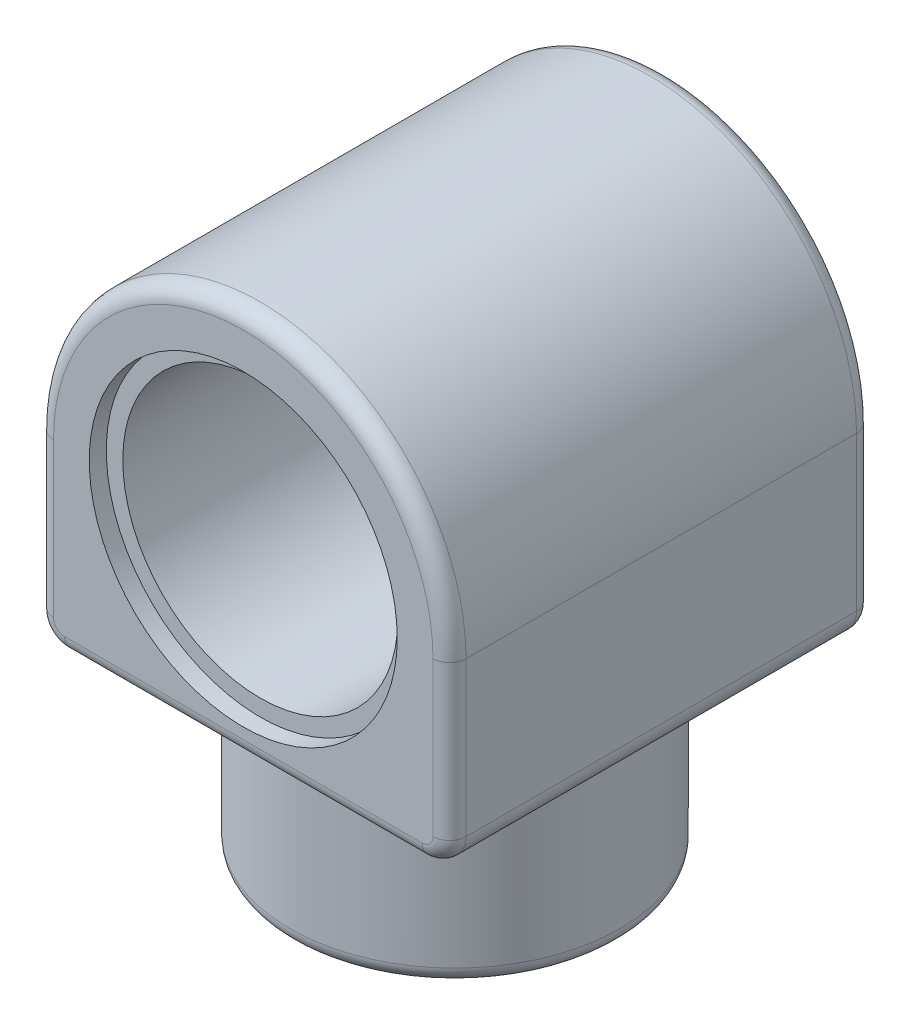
ISO-10303-21;
HEADER;
FILE_DESCRIPTION(('STEP AP214'),'2;1');
FILE_NAME('part.step','',(''),(''),'','','');
FILE_SCHEMA(('AUTOMOTIVE_DESIGN { 1 0 10303 214 1 1 1 1 }'));
ENDSEC;
DATA;
#1=APPLICATION_CONTEXT('core data for automotive mechanical design processes');
#2=APPLICATION_PROTOCOL_DEFINITION('international standard','automotive_design',2000,#1);
#3=PRODUCT_CONTEXT('',#1,'mechanical');
#4=PRODUCT('Part','Part','',(#3));
#5=PRODUCT_RELATED_PRODUCT_CATEGORY('part','',(#4));
#6=PRODUCT_DEFINITION_FORMATION('','',#4);
#7=PRODUCT_DEFINITION_CONTEXT('part definition',#1,'design');
#8=PRODUCT_DEFINITION('design','',#6,#7);
#9=PRODUCT_DEFINITION_SHAPE('','',#8);
#10=(LENGTH_UNIT() NAMED_UNIT(*) SI_UNIT(.MILLI.,.METRE.));
#11=(NAMED_UNIT(*) PLANE_ANGLE_UNIT() SI_UNIT($,.RADIAN.));
#12=(NAMED_UNIT(*) SI_UNIT($,.STERADIAN.) SOLID_ANGLE_UNIT());
#13=UNCERTAINTY_MEASURE_WITH_UNIT(LENGTH_MEASURE(1.E-05),#10,'distance_accuracy_value','');
#14=(GEOMETRIC_REPRESENTATION_CONTEXT(3) GLOBAL_UNCERTAINTY_ASSIGNED_CONTEXT((#13)) GLOBAL_UNIT_ASSIGNED_CONTEXT((#10,
#11,#12)) REPRESENTATION_CONTEXT('',''));
#15=CARTESIAN_POINT('',(0.,0.,0.));
#16=DIRECTION('',(0.,0.,1.));
#17=DIRECTION('',(1.,0.,0.));
#18=AXIS2_PLACEMENT_3D('',#15,#16,#17);
#19=CARTESIAN_POINT('',(0.,0.,-38.5));
#20=DIRECTION('',(0.,0.,1.));
#21=DIRECTION('',(1.,0.,0.));
#22=AXIS2_PLACEMENT_3D('',#19,#20,#21);
#23=PLANE('',#22);
#24=CARTESIAN_POINT('',(-18.1865334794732,10.5000000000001,-38.5));
#25=DIRECTION('',(0.,0.,-1.));
#26=DIRECTION('',(-1.,0.,0.));
#27=AXIS2_PLACEMENT_3D('',#24,#25,#26);
#28=CIRCLE('',#27,3.5);
#29=CARTESIAN_POINT('',(-21.6865334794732,10.5000000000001,-38.5));
#30=VERTEX_POINT('',#29);
#31=EDGE_CURVE('E820',#30,#30,#28,.T.);
#32=ORIENTED_EDGE('',*,*,#31,.F.);
#33=EDGE_LOOP('',(#32));
#34=FACE_BOUND('',#33,.T.);
#35=CARTESIAN_POINT('',(-32.4999999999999,-28.0000000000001,-38.5));
#36=DIRECTION('',(0.,0.,1.));
#37=DIRECTION('',(1.,0.,0.));
#38=AXIS2_PLACEMENT_3D('',#35,#36,#37);
#39=CIRCLE('',#38,2.);
#40=CARTESIAN_POINT('',(-32.5,-30.0000000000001,-38.5));
#41=VERTEX_POINT('',#40);
#42=CARTESIAN_POINT('',(-34.5,-28.,-38.5));
#43=VERTEX_POINT('',#42);
#44=EDGE_CURVE('E41',#41,#43,#39,.F.);
#45=ORIENTED_EDGE('',*,*,#44,.T.);
#46=DIRECTION('',(0.,-1.,0.));
#47=VECTOR('',#46,1.);
#48=CARTESIAN_POINT('',(-34.5,0.,-38.5));
#49=LINE('',#48,#47);
#50=CARTESIAN_POINT('',(-34.5,0.,-38.5));
#51=VERTEX_POINT('',#50);
#52=EDGE_CURVE('E11',#43,#51,#49,.F.);
#53=ORIENTED_EDGE('',*,*,#52,.T.);
#54=CARTESIAN_POINT('',(0.,0.,-38.5));
#55=DIRECTION('',(0.,0.,1.));
#56=DIRECTION('',(1.,0.,0.));
#57=AXIS2_PLACEMENT_3D('',#54,#55,#56);
#58=CIRCLE('',#57,34.5);
#59=CARTESIAN_POINT('',(34.5,0.,-38.5));
#60=VERTEX_POINT('',#59);
#61=EDGE_CURVE('E384',#51,#60,#58,.F.);
#62=ORIENTED_EDGE('',*,*,#61,.T.);
#63=DIRECTION('',(0.,1.,0.));
#64=VECTOR('',#63,1.);
#65=CARTESIAN_POINT('',(34.5,0.,-38.5));
#66=LINE('',#65,#64);
#67=CARTESIAN_POINT('',(34.5,-28.0000000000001,-38.5));
#68=VERTEX_POINT('',#67);
#69=EDGE_CURVE('E386',#60,#68,#66,.F.);
#70=ORIENTED_EDGE('',*,*,#69,.T.);
#71=CARTESIAN_POINT('',(32.5,-28.,-38.5));
#72=DIRECTION('',(0.,0.,1.));
#73=DIRECTION('',(1.,0.,0.));
#74=AXIS2_PLACEMENT_3D('',#71,#72,#73);
#75=CIRCLE('',#74,2.);
#76=CARTESIAN_POINT('',(32.5,-30.,-38.5));
#77=VERTEX_POINT('',#76);
#78=EDGE_CURVE('E388',#68,#77,#75,.F.);
#79=ORIENTED_EDGE('',*,*,#78,.T.);
#80=DIRECTION('',(1.,0.,0.));
#81=VECTOR('',#80,1.);
#82=CARTESIAN_POINT('',(0.,-30.0000000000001,-38.5));
#83=LINE('',#82,#81);
#84=EDGE_CURVE('E51',#77,#41,#83,.F.);
#85=ORIENTED_EDGE('',*,*,#84,.T.);
#86=EDGE_LOOP('',(#45,#53,#62,#70,#79,#85));
#87=FACE_BOUND('',#86,.T.);
#88=CARTESIAN_POINT('',(0.,0.,-38.5));
#89=DIRECTION('',(0.,0.,1.));
#90=DIRECTION('',(1.,0.,0.));
#91=AXIS2_PLACEMENT_3D('',#88,#89,#90);
#92=CIRCLE('',#91,13.5);
#93=CARTESIAN_POINT('',(13.5,0.,-38.5));
#94=VERTEX_POINT('',#93);
#95=EDGE_CURVE('E835',#94,#94,#92,.T.);
#96=ORIENTED_EDGE('',*,*,#95,.T.);
#97=EDGE_LOOP('',(#96));
#98=FACE_BOUND('',#97,.T.);
#99=CARTESIAN_POINT('',(0.,-21.,-38.5));
#100=DIRECTION('',(0.,0.,-1.));
#101=DIRECTION('',(-1.,0.,0.));
#102=AXIS2_PLACEMENT_3D('',#99,#100,#101);
#103=CIRCLE('',#102,3.5);
#104=CARTESIAN_POINT('',(-3.50000000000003,-21.,-38.5));
#105=VERTEX_POINT('',#104);
#106=EDGE_CURVE('E829',#105,#105,#103,.T.);
#107=ORIENTED_EDGE('',*,*,#106,.F.);
#108=EDGE_LOOP('',(#107));
#109=FACE_BOUND('',#108,.T.);
#110=CARTESIAN_POINT('',(18.1865334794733,10.4999999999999,-38.5));
#111=DIRECTION('',(0.,0.,-1.));
#112=DIRECTION('',(-1.,0.,0.));
#113=AXIS2_PLACEMENT_3D('',#110,#111,#112);
#114=CIRCLE('',#113,3.5);
#115=CARTESIAN_POINT('',(14.6865334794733,10.4999999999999,-38.5));
#116=VERTEX_POINT('',#115);
#117=EDGE_CURVE('E811',#116,#116,#114,.T.);
#118=ORIENTED_EDGE('',*,*,#117,.F.);
#119=EDGE_LOOP('',(#118));
#120=FACE_BOUND('',#119,.T.);
#121=ADVANCED_FACE('F32',(#34,#87,#98,#109,#120),#23,.F.);
#122=CARTESIAN_POINT('',(-32.5000000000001,-33.,38.4999999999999));
#123=DIRECTION('',(0.,1.,0.));
#124=DIRECTION('',(0.,0.,1.));
#125=AXIS2_PLACEMENT_3D('',#122,#123,#124);
#126=PLANE('',#125);
#127=DIRECTION('',(0.,0.,-1.));
#128=VECTOR('',#127,1.);
#129=CARTESIAN_POINT('',(32.4999999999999,-33.,38.5000000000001));
#130=LINE('',#129,#128);
#131=CARTESIAN_POINT('',(32.4999999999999,-33.,-5.72276157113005));
#132=VERTEX_POINT('',#131);
#133=CARTESIAN_POINT('',(32.5,-33.,-35.5));
#134=VERTEX_POINT('',#133);
#135=EDGE_CURVE('E469',#132,#134,#130,.T.);
#136=ORIENTED_EDGE('',*,*,#135,.F.);
#137=CARTESIAN_POINT('',(0.,-33.,0.));
#138=DIRECTION('',(0.,1.,0.));
#139=DIRECTION('',(0.,0.,1.));
#140=AXIS2_PLACEMENT_3D('',#137,#138,#139);
#141=CIRCLE('',#140,33.);
#142=CARTESIAN_POINT('',(-32.5000000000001,-32.9999999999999,-5.72276157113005));
#143=VERTEX_POINT('',#142);
#144=EDGE_CURVE('E342',#132,#143,#141,.T.);
#145=ORIENTED_EDGE('',*,*,#144,.T.);
#146=DIRECTION('',(0.,0.,-1.));
#147=VECTOR('',#146,1.);
#148=CARTESIAN_POINT('',(-32.5000000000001,-33.,38.4999999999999));
#149=LINE('',#148,#147);
#150=CARTESIAN_POINT('',(-32.5,-32.9999999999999,-35.5));
#151=VERTEX_POINT('',#150);
#152=EDGE_CURVE('E449',#143,#151,#149,.T.);
#153=ORIENTED_EDGE('',*,*,#152,.T.);
#154=DIRECTION('',(1.,0.,0.));
#155=VECTOR('',#154,1.);
#156=CARTESIAN_POINT('',(-32.5,-32.9999999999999,-35.5));
#157=LINE('',#156,#155);
#158=EDGE_CURVE('E401',#151,#134,#157,.T.);
#159=ORIENTED_EDGE('',*,*,#158,.T.);
#160=EDGE_LOOP('',(#136,#145,#153,#159));
#161=FACE_BOUND('',#160,.T.);
#162=ADVANCED_FACE('F290',(#161),#126,.F.);
#163=CARTESIAN_POINT('',(32.4999999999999,-33.,35.5000000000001));
#164=VERTEX_POINT('',#163);
#165=CARTESIAN_POINT('',(32.5,-33.,5.72276157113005));
#166=VERTEX_POINT('',#165);
#167=EDGE_CURVE('E441',#164,#166,#130,.T.);
#168=ORIENTED_EDGE('',*,*,#167,.F.);
#169=DIRECTION('',(1.,0.,0.));
#170=VECTOR('',#169,1.);
#171=CARTESIAN_POINT('',(-32.5000000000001,-33.,35.4999999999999));
#172=LINE('',#171,#170);
#173=CARTESIAN_POINT('',(-32.5000000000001,-33.,35.4999999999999));
#174=VERTEX_POINT('',#173);
#175=EDGE_CURVE('E357',#164,#174,#172,.F.);
#176=ORIENTED_EDGE('',*,*,#175,.T.);
#177=CARTESIAN_POINT('',(-32.5,-32.9999999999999,5.72276157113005));
#178=VERTEX_POINT('',#177);
#179=EDGE_CURVE('E440',#174,#178,#149,.T.);
#180=ORIENTED_EDGE('',*,*,#179,.T.);
#181=CARTESIAN_POINT('',(0.,-33.,0.));
#182=DIRECTION('',(0.,1.,0.));
#183=DIRECTION('',(0.,0.,1.));
#184=AXIS2_PLACEMENT_3D('',#181,#182,#183);
#185=CIRCLE('',#184,33.);
#186=EDGE_CURVE('E433',#178,#166,#185,.T.);
#187=ORIENTED_EDGE('',*,*,#186,.T.);
#188=EDGE_LOOP('',(#168,#176,#180,#187));
#189=FACE_BOUND('',#188,.T.);
#190=ADVANCED_FACE('F203',(#189),#126,.F.);
#191=CARTESIAN_POINT('',(0.,0.,38.5));
#192=DIRECTION('',(0.,0.,-1.));
#193=DIRECTION('',(-1.,0.,0.));
#194=AXIS2_PLACEMENT_3D('',#191,#192,#193);
#195=CYLINDRICAL_SURFACE('',#194,37.5);
#196=DIRECTION('',(0.,0.,-1.));
#197=VECTOR('',#196,1.);
#198=CARTESIAN_POINT('',(-37.5000000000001,0.,38.5));
#199=LINE('',#198,#197);
#200=CARTESIAN_POINT('',(-37.5000000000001,0.,35.5));
#201=VERTEX_POINT('',#200);
#202=CARTESIAN_POINT('',(-37.5,0.,-35.5));
#203=VERTEX_POINT('',#202);
#204=EDGE_CURVE('E165',#201,#203,#199,.T.);
#205=ORIENTED_EDGE('',*,*,#204,.F.);
#206=CARTESIAN_POINT('',(0.,0.,35.5));
#207=DIRECTION('',(0.,0.,1.));
#208=DIRECTION('',(1.,0.,0.));
#209=AXIS2_PLACEMENT_3D('',#206,#207,#208);
#210=CIRCLE('',#209,37.5);
#211=CARTESIAN_POINT('',(37.4999999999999,0.,35.5000000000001));
#212=VERTEX_POINT('',#211);
#213=EDGE_CURVE('E424',#201,#212,#210,.F.);
#214=ORIENTED_EDGE('',*,*,#213,.T.);
#215=DIRECTION('',(0.,0.,-1.));
#216=VECTOR('',#215,1.);
#217=CARTESIAN_POINT('',(37.4999999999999,0.,38.5000000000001));
#218=LINE('',#217,#216);
#219=CARTESIAN_POINT('',(37.5,0.,-35.5));
#220=VERTEX_POINT('',#219);
#221=EDGE_CURVE('E459',#212,#220,#218,.T.);
#222=ORIENTED_EDGE('',*,*,#221,.T.);
#223=CARTESIAN_POINT('',(0.,0.,-35.5));
#224=DIRECTION('',(0.,0.,1.));
#225=DIRECTION('',(1.,0.,0.));
#226=AXIS2_PLACEMENT_3D('',#223,#224,#225);
#227=CIRCLE('',#226,37.5);
#228=EDGE_CURVE('E419',#220,#203,#227,.T.);
#229=ORIENTED_EDGE('',*,*,#228,.T.);
#230=EDGE_LOOP('',(#205,#214,#222,#229));
#231=FACE_BOUND('',#230,.T.);
#232=ADVANCED_FACE('F484',(#231),#195,.T.);
#233=CARTESIAN_POINT('',(-37.5000000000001,0.,38.5));
#234=DIRECTION('',(1.,0.,0.));
#235=DIRECTION('',(0.,1.,0.));
#236=AXIS2_PLACEMENT_3D('',#233,#234,#235);
#237=PLANE('',#236);
#238=DIRECTION('',(0.,0.,-1.));
#239=VECTOR('',#238,1.);
#240=CARTESIAN_POINT('',(-37.5,-28.,38.4999999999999));
#241=LINE('',#240,#239);
#242=CARTESIAN_POINT('',(-37.5000000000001,-28.,35.4999999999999));
#243=VERTEX_POINT('',#242);
#244=CARTESIAN_POINT('',(-37.5,-28.,-35.5));
#245=VERTEX_POINT('',#244);
#246=EDGE_CURVE('E448',#243,#245,#241,.T.);
#247=ORIENTED_EDGE('',*,*,#246,.F.);
#248=DIRECTION('',(0.,-1.,0.));
#249=VECTOR('',#248,1.);
#250=CARTESIAN_POINT('',(-37.5000000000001,0.,35.5));
#251=LINE('',#250,#249);
#252=EDGE_CURVE('E425',#243,#201,#251,.F.);
#253=ORIENTED_EDGE('',*,*,#252,.T.);
#254=ORIENTED_EDGE('',*,*,#204,.T.);
#255=DIRECTION('',(0.,-1.,0.));
#256=VECTOR('',#255,1.);
#257=CARTESIAN_POINT('',(-37.5,0.,-35.5));
#258=LINE('',#257,#256);
#259=EDGE_CURVE('E355',#203,#245,#258,.T.);
#260=ORIENTED_EDGE('',*,*,#259,.T.);
#261=EDGE_LOOP('',(#247,#253,#254,#260));
#262=FACE_BOUND('',#261,.T.);
#263=ADVANCED_FACE('F483',(#262),#237,.F.);
#264=CARTESIAN_POINT('',(-32.5,-28.,38.4999999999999));
#265=DIRECTION('',(0.,0.,-1.));
#266=DIRECTION('',(-1.,0.,0.));
#267=AXIS2_PLACEMENT_3D('',#264,#265,#266);
#268=CYLINDRICAL_SURFACE('',#267,5.);
#269=ORIENTED_EDGE('',*,*,#179,.F.);
#270=CARTESIAN_POINT('',(-32.5,-28.,35.4999999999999));
#271=DIRECTION('',(0.,0.,1.));
#272=DIRECTION('',(1.,0.,0.));
#273=AXIS2_PLACEMENT_3D('',#270,#271,#272);
#274=CIRCLE('',#273,5.);
#275=EDGE_CURVE('E352',#174,#243,#274,.F.);
#276=ORIENTED_EDGE('',*,*,#275,.T.);
#277=ORIENTED_EDGE('',*,*,#246,.T.);
#278=CARTESIAN_POINT('',(-32.5,-28.0000000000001,-35.5));
#279=DIRECTION('',(0.,0.,1.));
#280=DIRECTION('',(1.,0.,0.));
#281=AXIS2_PLACEMENT_3D('',#278,#279,#280);
#282=CIRCLE('',#281,5.);
#283=EDGE_CURVE('E353',#245,#151,#282,.T.);
#284=ORIENTED_EDGE('',*,*,#283,.T.);
#285=ORIENTED_EDGE('',*,*,#152,.F.);
#286=CARTESIAN_POINT('',(-31.0269999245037,-32.7781032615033,-13.4308414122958));
#287=CARTESIAN_POINT('',(-27.6032051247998,-31.7226112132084,-11.7603257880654));
#288=CARTESIAN_POINT('',(-27.4029089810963,-35.6449652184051,-12.2098558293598));
#289=CARTESIAN_POINT('',(-31.1121655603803,-32.8043348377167,-13.1250414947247));
#290=CARTESIAN_POINT('',(-27.7015173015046,-31.8191347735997,-11.5276477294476));
#291=CARTESIAN_POINT('',(-27.5267862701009,-35.6869357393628,-11.9318559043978));
#292=CARTESIAN_POINT('',(-31.1945679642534,-32.8272685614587,-12.8166006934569));
#293=CARTESIAN_POINT('',(-27.8004997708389,-31.9094802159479,-11.2855429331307));
#294=CARTESIAN_POINT('',(-27.6466443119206,-35.7236296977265,-11.6514551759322));
#295=CARTESIAN_POINT('',(-31.3536311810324,-32.8675069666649,-12.1951081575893));
#296=CARTESIAN_POINT('',(-27.9956868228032,-32.0766671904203,-10.7894789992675));
#297=CARTESIAN_POINT('',(-27.8780089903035,-35.7880111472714,-11.0864619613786));
#298=CARTESIAN_POINT('',(-31.430293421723,-32.8848130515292,-11.8820575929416));
#299=CARTESIAN_POINT('',(-28.0920627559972,-32.1538529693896,-10.535420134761));
#300=CARTESIAN_POINT('',(-27.9895177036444,-35.8157008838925,-10.8018705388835));
#301=CARTESIAN_POINT('',(-31.5776162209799,-32.91475714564,-11.252237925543));
#302=CARTESIAN_POINT('',(-28.2802828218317,-32.2959814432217,-10.0175468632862));
#303=CARTESIAN_POINT('',(-28.203805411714,-35.863611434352,-10.2293072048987));
#304=CARTESIAN_POINT('',(-31.6482838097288,-32.9274006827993,-10.9354736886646));
#305=CARTESIAN_POINT('',(-28.3723196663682,-32.3612195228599,-9.75357980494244));
#306=CARTESIAN_POINT('',(-28.3065946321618,-35.8838410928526,-9.94133971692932));
#307=CARTESIAN_POINT('',(-31.7835927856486,-32.948883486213,-10.2983342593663));
#308=CARTESIAN_POINT('',(-28.5507615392,-32.4809598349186,-9.21717256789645));
#309=CARTESIAN_POINT('',(-28.5034076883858,-35.9182135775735,-9.36212205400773));
#310=CARTESIAN_POINT('',(-31.8482337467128,-32.9577224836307,-9.97795881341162));
#311=CARTESIAN_POINT('',(-28.637359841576,-32.5356903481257,-8.94451139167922));
#312=CARTESIAN_POINT('',(-28.5974309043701,-35.9323559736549,-9.07087164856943));
#313=CARTESIAN_POINT('',(-32.0330805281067,-32.9797052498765,-9.0114208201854));
#314=CARTESIAN_POINT('',(-28.8857564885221,-32.6848389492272,-8.12050905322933));
#315=CARTESIAN_POINT('',(-28.866298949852,-35.9675284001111,-8.19220074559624));
#316=CARTESIAN_POINT('',(-32.1440754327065,-32.9882903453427,-8.36042277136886));
#317=CARTESIAN_POINT('',(-29.0402981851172,-32.7670838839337,-7.55145749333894));
#318=CARTESIAN_POINT('',(-29.0277460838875,-35.9812645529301,-7.60038433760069));
#319=CARTESIAN_POINT('',(-32.3409712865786,-32.9984420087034,-7.04838736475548));
#320=CARTESIAN_POINT('',(-29.3165684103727,-32.9024516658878,-6.39422530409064));
#321=CARTESIAN_POINT('',(-29.3141400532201,-35.9975072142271,-6.40762487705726));
#322=CARTESIAN_POINT('',(-32.4268599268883,-33.000005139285,-6.38734524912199));
#323=CARTESIAN_POINT('',(-29.4396147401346,-32.956468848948,-5.80350920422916));
#324=CARTESIAN_POINT('',(-29.4390689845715,-36.0000082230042,-5.80667749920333));
#325=CARTESIAN_POINT('',(-32.5519484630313,-32.9999963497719,-5.25073441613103));
#326=CARTESIAN_POINT('',(-29.61970694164,-33.0305394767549,-4.78087716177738));
#327=CARTESIAN_POINT('',(-29.6210159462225,-35.9999941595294,-4.77339492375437));
#328=CARTESIAN_POINT('',(-32.5974656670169,-32.9992015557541,-4.77692065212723));
#329=CARTESIAN_POINT('',(-29.6857316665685,-33.0560182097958,-4.35285018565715));
#330=CARTESIAN_POINT('',(-29.6872227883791,-35.9987224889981,-4.34265513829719));
#331=CARTESIAN_POINT('',(-32.6755619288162,-32.997070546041,-3.82653372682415));
#332=CARTESIAN_POINT('',(-29.7991677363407,-33.0981729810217,-3.49235138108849));
#333=CARTESIAN_POINT('',(-29.8008173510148,-35.9953128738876,-3.47866702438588));
#334=CARTESIAN_POINT('',(-32.708140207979,-32.9957342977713,-3.34996040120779));
#335=CARTESIAN_POINT('',(-29.8468599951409,-33.1149675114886,-3.05883763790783));
#336=CARTESIAN_POINT('',(-29.8482039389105,-35.9931748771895,-3.0454185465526));
#337=CARTESIAN_POINT('',(-32.7602942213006,-32.9932881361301,-2.39494132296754));
#338=CARTESIAN_POINT('',(-29.9231821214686,-33.1412057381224,-2.18926831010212));
#339=CARTESIAN_POINT('',(-29.9240643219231,-35.9892610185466,-2.17721938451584));
#340=CARTESIAN_POINT('',(-32.7798684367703,-32.9921782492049,-1.91649535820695));
#341=CARTESIAN_POINT('',(-29.9520002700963,-33.1507180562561,-1.75214046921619));
#342=CARTESIAN_POINT('',(-29.9525359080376,-35.9874851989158,-1.74226850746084));
#343=CARTESIAN_POINT('',(-32.8059711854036,-32.9906465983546,-0.958699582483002));
#344=CARTESIAN_POINT('',(-29.9903610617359,-33.1632744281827,-0.877218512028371));
#345=CARTESIAN_POINT('',(-29.9905035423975,-35.9850345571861,-0.871545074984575));
#346=CARTESIAN_POINT('',(-32.8125,-32.9902248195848,-0.479349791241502));
#347=CARTESIAN_POINT('',(-30.,-33.1663504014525,-0.43833565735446));
#348=CARTESIAN_POINT('',(-30.,-35.9843597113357,-0.435772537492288));
#349=CARTESIAN_POINT('',(-32.8125,-32.9902248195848,0.479349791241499));
#350=CARTESIAN_POINT('',(-30.,-33.1663504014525,0.438335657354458));
#351=CARTESIAN_POINT('',(-30.,-35.9843597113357,0.435772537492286));
#352=CARTESIAN_POINT('',(-32.8059711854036,-32.9906465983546,0.958699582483));
#353=CARTESIAN_POINT('',(-29.9903610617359,-33.1632744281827,0.87721851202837));
#354=CARTESIAN_POINT('',(-29.9905035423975,-35.9850345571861,0.871545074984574));
#355=CARTESIAN_POINT('',(-32.7798684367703,-32.9921782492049,1.91649535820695));
#356=CARTESIAN_POINT('',(-29.9520002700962,-33.1507180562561,1.75214046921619));
#357=CARTESIAN_POINT('',(-29.9525359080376,-35.9874851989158,1.74226850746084));
#358=CARTESIAN_POINT('',(-32.7602942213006,-32.9932881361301,2.39494132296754));
#359=CARTESIAN_POINT('',(-29.9231821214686,-33.1412057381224,2.18926831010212));
#360=CARTESIAN_POINT('',(-29.9240643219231,-35.9892610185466,2.17721938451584));
#361=CARTESIAN_POINT('',(-32.708140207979,-32.9957342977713,3.34996040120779));
#362=CARTESIAN_POINT('',(-29.8468599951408,-33.1149675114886,3.05883763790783));
#363=CARTESIAN_POINT('',(-29.8482039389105,-35.9931748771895,3.0454185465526));
#364=CARTESIAN_POINT('',(-32.6755619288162,-32.997070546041,3.82653372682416));
#365=CARTESIAN_POINT('',(-29.7991677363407,-33.0981729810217,3.4923513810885));
#366=CARTESIAN_POINT('',(-29.8008173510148,-35.9953128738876,3.47866702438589));
#367=CARTESIAN_POINT('',(-32.5974656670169,-32.9992015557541,4.77692065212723));
#368=CARTESIAN_POINT('',(-29.6857316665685,-33.0560182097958,4.35285018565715));
#369=CARTESIAN_POINT('',(-29.6872227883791,-35.9987224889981,4.34265513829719));
#370=CARTESIAN_POINT('',(-32.5519484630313,-32.9999963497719,5.25073441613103));
#371=CARTESIAN_POINT('',(-29.61970694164,-33.0305394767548,4.78087716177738));
#372=CARTESIAN_POINT('',(-29.6210159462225,-35.9999941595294,4.77339492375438));
#373=CARTESIAN_POINT('',(-32.4268599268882,-33.000005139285,6.38734524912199));
#374=CARTESIAN_POINT('',(-29.4396147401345,-32.9564688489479,5.80350920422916));
#375=CARTESIAN_POINT('',(-29.4390689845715,-36.0000082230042,5.80667749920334));
#376=CARTESIAN_POINT('',(-32.3409712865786,-32.9984420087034,7.04838736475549));
#377=CARTESIAN_POINT('',(-29.3165684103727,-32.9024516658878,6.39422530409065));
#378=CARTESIAN_POINT('',(-29.3141400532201,-35.9975072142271,6.40762487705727));
#379=CARTESIAN_POINT('',(-32.1440754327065,-32.9882903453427,8.36042277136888));
#380=CARTESIAN_POINT('',(-29.0402981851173,-32.7670838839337,7.55145749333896));
#381=CARTESIAN_POINT('',(-29.0277460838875,-35.9812645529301,7.6003843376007));
#382=CARTESIAN_POINT('',(-32.0330805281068,-32.9797052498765,9.01142082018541));
#383=CARTESIAN_POINT('',(-28.8857564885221,-32.6848389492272,8.12050905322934));
#384=CARTESIAN_POINT('',(-28.866298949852,-35.9675284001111,8.19220074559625));
#385=CARTESIAN_POINT('',(-31.8482337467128,-32.9577224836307,9.97795881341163));
#386=CARTESIAN_POINT('',(-28.637359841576,-32.5356903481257,8.94451139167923));
#387=CARTESIAN_POINT('',(-28.5974309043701,-35.9323559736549,9.07087164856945));
#388=CARTESIAN_POINT('',(-31.7835927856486,-32.948883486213,10.2983342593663));
#389=CARTESIAN_POINT('',(-28.5507615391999,-32.4809598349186,9.21717256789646));
#390=CARTESIAN_POINT('',(-28.5034076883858,-35.9182135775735,9.36212205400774));
#391=CARTESIAN_POINT('',(-31.6482838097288,-32.9274006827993,10.9354736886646));
#392=CARTESIAN_POINT('',(-28.3723196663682,-32.3612195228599,9.75357980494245));
#393=CARTESIAN_POINT('',(-28.3065946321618,-35.8838410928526,9.94133971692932));
#394=CARTESIAN_POINT('',(-31.5776162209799,-32.91475714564,11.252237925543));
#395=CARTESIAN_POINT('',(-28.2802828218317,-32.2959814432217,10.0175468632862));
#396=CARTESIAN_POINT('',(-28.203805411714,-35.863611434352,10.2293072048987));
#397=CARTESIAN_POINT('',(-31.430293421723,-32.8848130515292,11.8820575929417));
#398=CARTESIAN_POINT('',(-28.0920627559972,-32.1538529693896,10.535420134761));
#399=CARTESIAN_POINT('',(-27.9895177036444,-35.8157008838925,10.8018705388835));
#400=CARTESIAN_POINT('',(-31.3536311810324,-32.8675069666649,12.1951081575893));
#401=CARTESIAN_POINT('',(-27.9956868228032,-32.0766671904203,10.7894789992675));
#402=CARTESIAN_POINT('',(-27.8780089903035,-35.7880111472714,11.0864619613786));
#403=CARTESIAN_POINT('',(-31.1945679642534,-32.8272685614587,12.8166006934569));
#404=CARTESIAN_POINT('',(-27.8004997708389,-31.9094802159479,11.2855429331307));
#405=CARTESIAN_POINT('',(-27.6466443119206,-35.7236296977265,11.6514551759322));
#406=CARTESIAN_POINT('',(-31.1121655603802,-32.8043348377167,13.1250414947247));
#407=CARTESIAN_POINT('',(-27.7015173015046,-31.8191347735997,11.5276477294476));
#408=CARTESIAN_POINT('',(-27.5267862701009,-35.6869357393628,11.9318559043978));
#409=CARTESIAN_POINT('',(-31.0269999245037,-32.7781032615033,13.4308414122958));
#410=CARTESIAN_POINT('',(-27.6032051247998,-31.7226112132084,11.7603257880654));
#411=CARTESIAN_POINT('',(-27.4029089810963,-35.6449652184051,12.2098558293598));
#412=(BOUNDED_SURFACE() B_SPLINE_SURFACE(3,2,((#286,#287,#288),(#289,#290,#291),(#292,#293,
#294),(#295,#296,#297),(#298,#299,#300),(#301,#302,#303),(#304,#305,#306),(#307,#308,#309),
(#310,#311,#312),(#313,#314,#315),(#316,#317,#318),(#319,#320,#321),(#322,#323,#324),(#325,#326,
#327),(#328,#329,#330),(#331,#332,#333),(#334,#335,#336),(#337,#338,#339),(#340,#341,#342),
(#343,#344,#345),(#346,#347,#348),(#349,#350,#351),(#352,#353,#354),(#355,#356,#357),(#358,#359,
#360),(#361,#362,#363),(#364,#365,#366),(#367,#368,#369),(#370,#371,#372),(#373,#374,#375),
(#376,#377,#378),(#379,#380,#381),(#382,#383,#384),(#385,#386,#387),(#388,#389,#390),(#391,#392,
#393),(#394,#395,#396),(#397,#398,#399),(#400,#401,#402),(#403,#404,#405),(#406,#407,#408),
(#409,#410,#411)),.UNSPECIFIED.,.F.,.F.,.F.) B_SPLINE_SURFACE_WITH_KNOTS((4,2,2,2,2,2,2,2,2,2,2,
2,2,2,2,2,2,2,2,2,4),(3,3),(0.,1.01206920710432,2.02388583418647,3.03449896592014,
4.04518349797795,6.06839794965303,8.09260267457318,9.53031417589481,10.968112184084,
12.4060780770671,13.8440129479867,15.2819478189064,16.7199137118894,18.1577117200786,
19.5954232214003,21.6196279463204,23.6428423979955,24.6535269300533,25.664140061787,
26.6759566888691,27.6880258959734),(0.,1.),
.UNSPECIFIED.) GEOMETRIC_REPRESENTATION_ITEM() RATIONAL_B_SPLINE_SURFACE(((1.,0.604526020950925,
1.),(1.,0.610457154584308,1.),(1.,0.61619582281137,1.),(1.,0.627273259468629,1.),(1.,
0.632612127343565,1.),(1.,0.642871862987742,1.),(1.,0.647793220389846,1.),(1.,0.657216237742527,
1.),(1.,0.661717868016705,1.),(1.,0.674590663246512,1.),(1.,0.682320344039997,1.),(1.,
0.696032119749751,1.),(1.,0.702013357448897,1.),(1.,0.710724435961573,1.),(1.,0.713894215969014,
1.),(1.,0.719332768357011,1.),(1.,0.721601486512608,1.),(1.,0.725233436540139,1.),(1.,
0.72659656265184,1.),(1.,0.728414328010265,1.),(1.,0.728868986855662,1.),(1.,0.728868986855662,
1.),(1.,0.728414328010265,1.),(1.,0.72659656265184,1.),(1.,0.725233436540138,1.),(1.,
0.721601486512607,1.),(1.,0.719332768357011,1.),(1.,0.713894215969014,1.),(1.,0.710724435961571,
1.),(1.,0.702013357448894,1.),(1.,0.69603211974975,1.),(1.,0.682320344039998,1.),(1.,
0.674590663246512,1.),(1.,0.661717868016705,1.),(1.,0.657216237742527,1.),(1.,0.647793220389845,
1.),(1.,0.642871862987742,1.),(1.,0.632612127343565,1.),(1.,0.627273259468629,1.),(1.,
0.61619582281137,1.),(1.,0.610457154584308,1.),(1.,0.604526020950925,1.))) REPRESENTATION_ITEM('') SURFACE());
#413=CARTESIAN_POINT('',(-31.0269999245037,-32.7781032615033,-13.4308414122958));
#414=CARTESIAN_POINT('',(-31.1121655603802,-32.8043348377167,-13.1250414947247));
#415=CARTESIAN_POINT('',(-31.1945679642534,-32.8272685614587,-12.8166006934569));
#416=CARTESIAN_POINT('',(-31.3536311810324,-32.8675069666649,-12.1951081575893));
#417=CARTESIAN_POINT('',(-31.430293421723,-32.8848130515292,-11.8820575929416));
#418=CARTESIAN_POINT('',(-31.5776162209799,-32.91475714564,-11.252237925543));
#419=CARTESIAN_POINT('',(-31.6482838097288,-32.9274006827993,-10.9354736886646));
#420=CARTESIAN_POINT('',(-31.7835927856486,-32.948883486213,-10.2983342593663));
#421=CARTESIAN_POINT('',(-31.8482337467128,-32.9577224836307,-9.97795881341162));
#422=CARTESIAN_POINT('',(-32.0330805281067,-32.9797052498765,-9.0114208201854));
#423=CARTESIAN_POINT('',(-32.1440754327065,-32.9882903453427,-8.36042277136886));
#424=CARTESIAN_POINT('',(-32.3409712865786,-32.9984420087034,-7.04838736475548));
#425=CARTESIAN_POINT('',(-32.4268599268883,-33.000005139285,-6.38734524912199));
#426=CARTESIAN_POINT('',(-32.5519484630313,-32.9999963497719,-5.25073441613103));
#427=CARTESIAN_POINT('',(-32.5974656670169,-32.9992015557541,-4.77692065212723));
#428=CARTESIAN_POINT('',(-32.6755619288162,-32.9970705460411,-3.82653372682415));
#429=CARTESIAN_POINT('',(-32.708140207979,-32.9957342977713,-3.34996040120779));
#430=CARTESIAN_POINT('',(-32.7602942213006,-32.9932881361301,-2.39494132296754));
#431=CARTESIAN_POINT('',(-32.7798684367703,-32.9921782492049,-1.91649535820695));
#432=CARTESIAN_POINT('',(-32.8059711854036,-32.9906465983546,-0.958699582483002));
#433=CARTESIAN_POINT('',(-32.8125,-32.9902248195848,-0.479349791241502));
#434=CARTESIAN_POINT('',(-32.8125,-32.9902248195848,0.4793497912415));
#435=CARTESIAN_POINT('',(-32.8059711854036,-32.9906465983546,0.958699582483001));
#436=CARTESIAN_POINT('',(-32.7798684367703,-32.9921782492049,1.91649535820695));
#437=CARTESIAN_POINT('',(-32.7602942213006,-32.9932881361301,2.39494132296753));
#438=CARTESIAN_POINT('',(-32.708140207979,-32.9957342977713,3.34996040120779));
#439=CARTESIAN_POINT('',(-32.6755619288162,-32.9970705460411,3.82653372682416));
#440=CARTESIAN_POINT('',(-32.5974656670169,-32.9992015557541,4.77692065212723));
#441=CARTESIAN_POINT('',(-32.5519484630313,-32.9999963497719,5.25073441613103));
#442=CARTESIAN_POINT('',(-32.4268599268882,-33.000005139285,6.38734524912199));
#443=CARTESIAN_POINT('',(-32.3409712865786,-32.9984420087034,7.04838736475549));
#444=CARTESIAN_POINT('',(-32.1440754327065,-32.9882903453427,8.36042277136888));
#445=CARTESIAN_POINT('',(-32.0330805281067,-32.9797052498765,9.01142082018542));
#446=CARTESIAN_POINT('',(-31.8482337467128,-32.9577224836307,9.97795881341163));
#447=CARTESIAN_POINT('',(-31.7835927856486,-32.948883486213,10.2983342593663));
#448=CARTESIAN_POINT('',(-31.6482838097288,-32.9274006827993,10.9354736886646));
#449=CARTESIAN_POINT('',(-31.5776162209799,-32.91475714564,11.252237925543));
#450=CARTESIAN_POINT('',(-31.430293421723,-32.8848130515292,11.8820575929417));
#451=CARTESIAN_POINT('',(-31.3536311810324,-32.8675069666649,12.1951081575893));
#452=CARTESIAN_POINT('',(-31.1945679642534,-32.8272685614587,12.8166006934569));
#453=CARTESIAN_POINT('',(-31.1121655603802,-32.8043348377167,13.1250414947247));
#454=CARTESIAN_POINT('',(-31.0269999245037,-32.7781032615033,13.4308414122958));
#455=B_SPLINE_CURVE_WITH_KNOTS('',3,(#413,#414,#415,#416,#417,#418,#419,#420,#421,#422,#423,
#424,#425,#426,#427,#428,#429,#430,#431,#432,#433,#434,#435,#436,#437,#438,#439,#440,#441,#442,
#443,#444,#445,#446,#447,#448,#449,#450,#451,#452,#453,#454),.UNSPECIFIED.,.F.,.F.,(4,2,2,2,2,2,
2,2,2,2,2,2,2,2,2,2,2,2,2,2,4),(0.,1.01206920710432,2.02388583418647,3.03449896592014,
4.04518349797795,6.06839794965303,8.09260267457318,9.53031417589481,10.968112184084,
12.4060780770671,13.8440129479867,15.2819478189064,16.7199137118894,18.1577117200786,
19.5954232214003,21.6196279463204,23.6428423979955,24.6535269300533,25.664140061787,
26.6759566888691,27.6880258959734),.UNSPECIFIED.);
#456=EDGE_CURVE('E347',#143,#178,#455,.T.);
#457=ORIENTED_EDGE('',*,*,#456,.T.);
#458=EDGE_LOOP('',(#269,#276,#277,#284,#285,#457));
#459=FACE_BOUND('',#458,.T.);
#460=ADVANCED_FACE('F200',(#459),#268,.T.);
#461=CARTESIAN_POINT('',(32.4999999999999,-28.,38.5000000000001));
#462=DIRECTION('',(0.,0.,-1.));
#463=DIRECTION('',(-1.,0.,0.));
#464=AXIS2_PLACEMENT_3D('',#461,#462,#463);
#465=CYLINDRICAL_SURFACE('',#464,5.);
#466=DIRECTION('',(0.,0.,-1.));
#467=VECTOR('',#466,1.);
#468=CARTESIAN_POINT('',(37.4999999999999,-27.9999999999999,38.5));
#469=LINE('',#468,#467);
#470=CARTESIAN_POINT('',(37.4999999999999,-27.9999999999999,35.5));
#471=VERTEX_POINT('',#470);
#472=CARTESIAN_POINT('',(37.5,-28.,-35.5));
#473=VERTEX_POINT('',#472);
#474=EDGE_CURVE('E461',#471,#473,#469,.T.);
#475=ORIENTED_EDGE('',*,*,#474,.F.);
#476=CARTESIAN_POINT('',(32.4999999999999,-28.,35.5000000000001));
#477=DIRECTION('',(0.,0.,1.));
#478=DIRECTION('',(1.,0.,0.));
#479=AXIS2_PLACEMENT_3D('',#476,#477,#478);
#480=CIRCLE('',#479,5.);
#481=EDGE_CURVE('E189',#471,#164,#480,.F.);
#482=ORIENTED_EDGE('',*,*,#481,.T.);
#483=ORIENTED_EDGE('',*,*,#167,.T.);
#484=CARTESIAN_POINT('',(31.0269999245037,-32.7781032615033,13.4308414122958));
#485=CARTESIAN_POINT('',(27.6032051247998,-31.7226112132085,11.7603257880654));
#486=CARTESIAN_POINT('',(27.4029089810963,-35.6449652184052,12.2098558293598));
#487=CARTESIAN_POINT('',(31.1121655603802,-32.8043348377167,13.1250414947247));
#488=CARTESIAN_POINT('',(27.7015173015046,-31.8191347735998,11.5276477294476));
#489=CARTESIAN_POINT('',(27.5267862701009,-35.6869357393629,11.9318559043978));
#490=CARTESIAN_POINT('',(31.1945679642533,-32.8272685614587,12.8166006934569));
#491=CARTESIAN_POINT('',(27.8004997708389,-31.9094802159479,11.2855429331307));
#492=CARTESIAN_POINT('',(27.6466443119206,-35.7236296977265,11.6514551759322));
#493=CARTESIAN_POINT('',(31.3536311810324,-32.8675069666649,12.1951081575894));
#494=CARTESIAN_POINT('',(27.9956868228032,-32.0766671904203,10.7894789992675));
#495=CARTESIAN_POINT('',(27.8780089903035,-35.7880111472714,11.0864619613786));
#496=CARTESIAN_POINT('',(31.430293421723,-32.8848130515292,11.8820575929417));
#497=CARTESIAN_POINT('',(28.0920627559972,-32.1538529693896,10.535420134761));
#498=CARTESIAN_POINT('',(27.9895177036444,-35.8157008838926,10.8018705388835));
#499=CARTESIAN_POINT('',(31.5776162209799,-32.9147571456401,11.252237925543));
#500=CARTESIAN_POINT('',(28.2802828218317,-32.2959814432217,10.0175468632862));
#501=CARTESIAN_POINT('',(28.203805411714,-35.863611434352,10.2293072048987));
#502=CARTESIAN_POINT('',(31.6482838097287,-32.9274006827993,10.9354736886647));
#503=CARTESIAN_POINT('',(28.3723196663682,-32.36121952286,9.75357980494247));
#504=CARTESIAN_POINT('',(28.3065946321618,-35.8838410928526,9.94133971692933));
#505=CARTESIAN_POINT('',(31.7835927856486,-32.948883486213,10.2983342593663));
#506=CARTESIAN_POINT('',(28.5507615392,-32.4809598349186,9.21717256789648));
#507=CARTESIAN_POINT('',(28.5034076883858,-35.9182135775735,9.36212205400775));
#508=CARTESIAN_POINT('',(31.8482337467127,-32.9577224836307,9.97795881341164));
#509=CARTESIAN_POINT('',(28.637359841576,-32.5356903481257,8.94451139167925));
#510=CARTESIAN_POINT('',(28.5974309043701,-35.932355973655,9.07087164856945));
#511=CARTESIAN_POINT('',(32.0330805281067,-32.9797052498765,9.01142082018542));
#512=CARTESIAN_POINT('',(28.8857564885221,-32.6848389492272,8.12050905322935));
#513=CARTESIAN_POINT('',(28.866298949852,-35.9675284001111,8.19220074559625));
#514=CARTESIAN_POINT('',(32.1440754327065,-32.9882903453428,8.36042277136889));
#515=CARTESIAN_POINT('',(29.0402981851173,-32.7670838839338,7.55145749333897));
#516=CARTESIAN_POINT('',(29.0277460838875,-35.9812645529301,7.60038433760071));
#517=CARTESIAN_POINT('',(32.3409712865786,-32.9984420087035,7.0483873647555));
#518=CARTESIAN_POINT('',(29.3165684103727,-32.9024516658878,6.39422530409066));
#519=CARTESIAN_POINT('',(29.3141400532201,-35.9975072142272,6.40762487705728));
#520=CARTESIAN_POINT('',(32.4268599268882,-33.000005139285,6.38734524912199));
#521=CARTESIAN_POINT('',(29.4396147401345,-32.9564688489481,5.80350920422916));
#522=CARTESIAN_POINT('',(29.4390689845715,-36.0000082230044,5.80667749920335));
#523=CARTESIAN_POINT('',(32.5519484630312,-32.9999963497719,5.25073441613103));
#524=CARTESIAN_POINT('',(29.6197069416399,-33.030539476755,4.78087716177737));
#525=CARTESIAN_POINT('',(29.6210159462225,-35.9999941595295,4.77339492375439));
#526=CARTESIAN_POINT('',(32.5974656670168,-32.9992015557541,4.77692065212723));
#527=CARTESIAN_POINT('',(29.6857316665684,-33.0560182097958,4.35285018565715));
#528=CARTESIAN_POINT('',(29.6872227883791,-35.9987224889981,4.34265513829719));
#529=CARTESIAN_POINT('',(32.6755619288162,-32.9970705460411,3.82653372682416));
#530=CARTESIAN_POINT('',(29.7991677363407,-33.0981729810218,3.49235138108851));
#531=CARTESIAN_POINT('',(29.8008173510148,-35.9953128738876,3.47866702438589));
#532=CARTESIAN_POINT('',(32.708140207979,-32.9957342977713,3.34996040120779));
#533=CARTESIAN_POINT('',(29.8468599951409,-33.1149675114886,3.05883763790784));
#534=CARTESIAN_POINT('',(29.8482039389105,-35.9931748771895,3.0454185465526));
#535=CARTESIAN_POINT('',(32.7602942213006,-32.9932881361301,2.39494132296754));
#536=CARTESIAN_POINT('',(29.9231821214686,-33.1412057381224,2.18926831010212));
#537=CARTESIAN_POINT('',(29.9240643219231,-35.9892610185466,2.17721938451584));
#538=CARTESIAN_POINT('',(32.7798684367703,-32.9921782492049,1.91649535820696));
#539=CARTESIAN_POINT('',(29.9520002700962,-33.1507180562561,1.75214046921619));
#540=CARTESIAN_POINT('',(29.9525359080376,-35.9874851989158,1.74226850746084));
#541=CARTESIAN_POINT('',(32.8059711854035,-32.9906465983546,0.958699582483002));
#542=CARTESIAN_POINT('',(29.9903610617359,-33.1632744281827,0.877218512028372));
#543=CARTESIAN_POINT('',(29.9905035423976,-35.9850345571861,0.871545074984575));
#544=CARTESIAN_POINT('',(32.8125,-32.9902248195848,0.479349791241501));
#545=CARTESIAN_POINT('',(30.,-33.1663504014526,0.438335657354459));
#546=CARTESIAN_POINT('',(30.,-35.9843597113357,0.435772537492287));
#547=CARTESIAN_POINT('',(32.8125,-32.9902248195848,-0.479349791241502));
#548=CARTESIAN_POINT('',(30.,-33.1663504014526,-0.43833565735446));
#549=CARTESIAN_POINT('',(30.,-35.9843597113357,-0.435772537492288));
#550=CARTESIAN_POINT('',(32.8059711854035,-32.9906465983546,-0.958699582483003));
#551=CARTESIAN_POINT('',(29.9903610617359,-33.1632744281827,-0.877218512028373));
#552=CARTESIAN_POINT('',(29.9905035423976,-35.9850345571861,-0.871545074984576));
#553=CARTESIAN_POINT('',(32.7798684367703,-32.9921782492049,-1.91649535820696));
#554=CARTESIAN_POINT('',(29.9520002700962,-33.1507180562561,-1.75214046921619));
#555=CARTESIAN_POINT('',(29.9525359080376,-35.9874851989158,-1.74226850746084));
#556=CARTESIAN_POINT('',(32.7602942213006,-32.9932881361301,-2.39494132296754));
#557=CARTESIAN_POINT('',(29.9231821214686,-33.1412057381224,-2.18926831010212));
#558=CARTESIAN_POINT('',(29.9240643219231,-35.9892610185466,-2.17721938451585));
#559=CARTESIAN_POINT('',(32.708140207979,-32.9957342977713,-3.3499604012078));
#560=CARTESIAN_POINT('',(29.8468599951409,-33.1149675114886,-3.05883763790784));
#561=CARTESIAN_POINT('',(29.8482039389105,-35.9931748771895,-3.0454185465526));
#562=CARTESIAN_POINT('',(32.6755619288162,-32.9970705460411,-3.82653372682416));
#563=CARTESIAN_POINT('',(29.7991677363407,-33.0981729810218,-3.49235138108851));
#564=CARTESIAN_POINT('',(29.8008173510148,-35.9953128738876,-3.47866702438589));
#565=CARTESIAN_POINT('',(32.5974656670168,-32.9992015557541,-4.77692065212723));
#566=CARTESIAN_POINT('',(29.6857316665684,-33.0560182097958,-4.35285018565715));
#567=CARTESIAN_POINT('',(29.6872227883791,-35.9987224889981,-4.3426551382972));
#568=CARTESIAN_POINT('',(32.5519484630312,-32.9999963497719,-5.25073441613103));
#569=CARTESIAN_POINT('',(29.6197069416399,-33.030539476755,-4.78087716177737));
#570=CARTESIAN_POINT('',(29.6210159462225,-35.9999941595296,-4.77339492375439));
#571=CARTESIAN_POINT('',(32.4268599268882,-33.000005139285,-6.38734524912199));
#572=CARTESIAN_POINT('',(29.4396147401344,-32.9564688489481,-5.80350920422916));
#573=CARTESIAN_POINT('',(29.4390689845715,-36.0000082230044,-5.80667749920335));
#574=CARTESIAN_POINT('',(32.3409712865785,-32.9984420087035,-7.0483873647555));
#575=CARTESIAN_POINT('',(29.3165684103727,-32.9024516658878,-6.39422530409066));
#576=CARTESIAN_POINT('',(29.3141400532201,-35.9975072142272,-6.40762487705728));
#577=CARTESIAN_POINT('',(32.1440754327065,-32.9882903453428,-8.3604227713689));
#578=CARTESIAN_POINT('',(29.0402981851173,-32.7670838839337,-7.55145749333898));
#579=CARTESIAN_POINT('',(29.0277460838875,-35.9812645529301,-7.60038433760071));
#580=CARTESIAN_POINT('',(32.0330805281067,-32.9797052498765,-9.01142082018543));
#581=CARTESIAN_POINT('',(28.8857564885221,-32.6848389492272,-8.12050905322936));
#582=CARTESIAN_POINT('',(28.866298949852,-35.9675284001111,-8.19220074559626));
#583=CARTESIAN_POINT('',(31.8482337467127,-32.9577224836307,-9.97795881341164));
#584=CARTESIAN_POINT('',(28.637359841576,-32.5356903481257,-8.94451139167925));
#585=CARTESIAN_POINT('',(28.5974309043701,-35.932355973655,-9.07087164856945));
#586=CARTESIAN_POINT('',(31.7835927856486,-32.948883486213,-10.2983342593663));
#587=CARTESIAN_POINT('',(28.5507615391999,-32.4809598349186,-9.21717256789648));
#588=CARTESIAN_POINT('',(28.5034076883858,-35.9182135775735,-9.36212205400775));
#589=CARTESIAN_POINT('',(31.6482838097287,-32.9274006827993,-10.9354736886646));
#590=CARTESIAN_POINT('',(28.3723196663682,-32.36121952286,-9.75357980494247));
#591=CARTESIAN_POINT('',(28.3065946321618,-35.8838410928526,-9.94133971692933));
#592=CARTESIAN_POINT('',(31.5776162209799,-32.9147571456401,-11.252237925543));
#593=CARTESIAN_POINT('',(28.2802828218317,-32.2959814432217,-10.0175468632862));
#594=CARTESIAN_POINT('',(28.203805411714,-35.863611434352,-10.2293072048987));
#595=CARTESIAN_POINT('',(31.430293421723,-32.8848130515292,-11.8820575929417));
#596=CARTESIAN_POINT('',(28.0920627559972,-32.1538529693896,-10.535420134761));
#597=CARTESIAN_POINT('',(27.9895177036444,-35.8157008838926,-10.8018705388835));
#598=CARTESIAN_POINT('',(31.3536311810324,-32.8675069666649,-12.1951081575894));
#599=CARTESIAN_POINT('',(27.9956868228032,-32.0766671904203,-10.7894789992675));
#600=CARTESIAN_POINT('',(27.8780089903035,-35.7880111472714,-11.0864619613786));
#601=CARTESIAN_POINT('',(31.1945679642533,-32.8272685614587,-12.8166006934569));
#602=CARTESIAN_POINT('',(27.8004997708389,-31.9094802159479,-11.2855429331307));
#603=CARTESIAN_POINT('',(27.6466443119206,-35.7236296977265,-11.6514551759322));
#604=CARTESIAN_POINT('',(31.1121655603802,-32.8043348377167,-13.1250414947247));
#605=CARTESIAN_POINT('',(27.7015173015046,-31.8191347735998,-11.5276477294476));
#606=CARTESIAN_POINT('',(27.5267862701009,-35.6869357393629,-11.9318559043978));
#607=CARTESIAN_POINT('',(31.0269999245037,-32.7781032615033,-13.4308414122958));
#608=CARTESIAN_POINT('',(27.6032051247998,-31.7226112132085,-11.7603257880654));
#609=CARTESIAN_POINT('',(27.4029089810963,-35.6449652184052,-12.2098558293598));
#610=(BOUNDED_SURFACE() B_SPLINE_SURFACE(3,2,((#484,#485,#486),(#487,#488,#489),(#490,#491,
#492),(#493,#494,#495),(#496,#497,#498),(#499,#500,#501),(#502,#503,#504),(#505,#506,#507),
(#508,#509,#510),(#511,#512,#513),(#514,#515,#516),(#517,#518,#519),(#520,#521,#522),(#523,#524,
#525),(#526,#527,#528),(#529,#530,#531),(#532,#533,#534),(#535,#536,#537),(#538,#539,#540),
(#541,#542,#543),(#544,#545,#546),(#547,#548,#549),(#550,#551,#552),(#553,#554,#555),(#556,#557,
#558),(#559,#560,#561),(#562,#563,#564),(#565,#566,#567),(#568,#569,#570),(#571,#572,#573),
(#574,#575,#576),(#577,#578,#579),(#580,#581,#582),(#583,#584,#585),(#586,#587,#588),(#589,#590,
#591),(#592,#593,#594),(#595,#596,#597),(#598,#599,#600),(#601,#602,#603),(#604,#605,#606),
(#607,#608,#609)),.UNSPECIFIED.,.F.,.F.,.F.) B_SPLINE_SURFACE_WITH_KNOTS((4,2,2,2,2,2,2,2,2,2,2,
2,2,2,2,2,2,2,2,2,4),(3,3),(0.,1.01206920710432,2.02388583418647,3.03449896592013,
4.04518349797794,6.06839794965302,8.09260267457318,9.53031417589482,10.968112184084,
12.4060780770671,13.8440129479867,15.2819478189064,16.7199137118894,18.1577117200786,
19.5954232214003,21.6196279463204,23.6428423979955,24.6535269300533,25.664140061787,
26.6759566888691,27.6880258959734),(0.,1.),
.UNSPECIFIED.) GEOMETRIC_REPRESENTATION_ITEM() RATIONAL_B_SPLINE_SURFACE(((1.,0.604526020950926,
1.),(1.,0.610457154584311,1.),(1.,0.616195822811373,1.),(1.,0.627273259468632,1.),(1.,
0.632612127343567,1.),(1.,0.642871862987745,1.),(1.,0.647793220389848,1.),(1.,0.65721623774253,
1.),(1.,0.661717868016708,1.),(1.,0.674590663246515,1.),(1.,0.682320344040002,1.),(1.,
0.696032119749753,1.),(1.,0.702013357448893,1.),(1.,0.710724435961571,1.),(1.,0.713894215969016,
1.),(1.,0.719332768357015,1.),(1.,0.721601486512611,1.),(1.,0.725233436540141,1.),(1.,
0.726596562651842,1.),(1.,0.728414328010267,1.),(1.,0.728868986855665,1.),(1.,0.728868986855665,
1.),(1.,0.728414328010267,1.),(1.,0.726596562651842,1.),(1.,0.725233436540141,1.),(1.,
0.721601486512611,1.),(1.,0.719332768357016,1.),(1.,0.713894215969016,1.),(1.,0.710724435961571,
1.),(1.,0.702013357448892,1.),(1.,0.696032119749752,1.),(1.,0.682320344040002,1.),(1.,
0.674590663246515,1.),(1.,0.661717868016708,1.),(1.,0.65721623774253,1.),(1.,0.647793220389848,
1.),(1.,0.642871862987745,1.),(1.,0.632612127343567,1.),(1.,0.627273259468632,1.),(1.,
0.616195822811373,1.),(1.,0.610457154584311,1.),(1.,0.604526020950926,1.))) REPRESENTATION_ITEM('') SURFACE());
#611=CARTESIAN_POINT('',(31.0269999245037,-32.7781032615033,13.4308414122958));
#612=CARTESIAN_POINT('',(31.1121655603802,-32.8043348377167,13.1250414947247));
#613=CARTESIAN_POINT('',(31.1945679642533,-32.8272685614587,12.8166006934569));
#614=CARTESIAN_POINT('',(31.3536311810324,-32.8675069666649,12.1951081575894));
#615=CARTESIAN_POINT('',(31.430293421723,-32.8848130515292,11.8820575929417));
#616=CARTESIAN_POINT('',(31.5776162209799,-32.9147571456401,11.252237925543));
#617=CARTESIAN_POINT('',(31.6482838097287,-32.9274006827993,10.9354736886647));
#618=CARTESIAN_POINT('',(31.7835927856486,-32.948883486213,10.2983342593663));
#619=CARTESIAN_POINT('',(31.8482337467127,-32.9577224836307,9.97795881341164));
#620=CARTESIAN_POINT('',(32.0330805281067,-32.9797052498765,9.01142082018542));
#621=CARTESIAN_POINT('',(32.1440754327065,-32.9882903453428,8.36042277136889));
#622=CARTESIAN_POINT('',(32.3409712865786,-32.9984420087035,7.0483873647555));
#623=CARTESIAN_POINT('',(32.4268599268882,-33.000005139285,6.38734524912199));
#624=CARTESIAN_POINT('',(32.5519484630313,-32.9999963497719,5.25073441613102));
#625=CARTESIAN_POINT('',(32.5974656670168,-32.9992015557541,4.77692065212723));
#626=CARTESIAN_POINT('',(32.6755619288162,-32.9970705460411,3.82653372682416));
#627=CARTESIAN_POINT('',(32.708140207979,-32.9957342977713,3.34996040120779));
#628=CARTESIAN_POINT('',(32.7602942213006,-32.9932881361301,2.39494132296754));
#629=CARTESIAN_POINT('',(32.7798684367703,-32.9921782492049,1.91649535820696));
#630=CARTESIAN_POINT('',(32.8059711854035,-32.9906465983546,0.958699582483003));
#631=CARTESIAN_POINT('',(32.8125,-32.9902248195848,0.479349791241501));
#632=CARTESIAN_POINT('',(32.8125,-32.9902248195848,-0.479349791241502));
#633=CARTESIAN_POINT('',(32.8059711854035,-32.9906465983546,-0.958699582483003));
#634=CARTESIAN_POINT('',(32.7798684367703,-32.9921782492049,-1.91649535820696));
#635=CARTESIAN_POINT('',(32.7602942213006,-32.9932881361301,-2.39494132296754));
#636=CARTESIAN_POINT('',(32.708140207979,-32.9957342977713,-3.3499604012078));
#637=CARTESIAN_POINT('',(32.6755619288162,-32.9970705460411,-3.82653372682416));
#638=CARTESIAN_POINT('',(32.5974656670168,-32.9992015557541,-4.77692065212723));
#639=CARTESIAN_POINT('',(32.5519484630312,-32.9999963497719,-5.25073441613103));
#640=CARTESIAN_POINT('',(32.4268599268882,-33.000005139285,-6.38734524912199));
#641=CARTESIAN_POINT('',(32.3409712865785,-32.9984420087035,-7.0483873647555));
#642=CARTESIAN_POINT('',(32.1440754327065,-32.9882903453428,-8.3604227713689));
#643=CARTESIAN_POINT('',(32.0330805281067,-32.9797052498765,-9.01142082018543));
#644=CARTESIAN_POINT('',(31.8482337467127,-32.9577224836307,-9.97795881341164));
#645=CARTESIAN_POINT('',(31.7835927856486,-32.948883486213,-10.2983342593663));
#646=CARTESIAN_POINT('',(31.6482838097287,-32.9274006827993,-10.9354736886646));
#647=CARTESIAN_POINT('',(31.5776162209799,-32.9147571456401,-11.252237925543));
#648=CARTESIAN_POINT('',(31.430293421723,-32.8848130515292,-11.8820575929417));
#649=CARTESIAN_POINT('',(31.3536311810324,-32.8675069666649,-12.1951081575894));
#650=CARTESIAN_POINT('',(31.1945679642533,-32.8272685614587,-12.8166006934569));
#651=CARTESIAN_POINT('',(31.1121655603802,-32.8043348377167,-13.1250414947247));
#652=CARTESIAN_POINT('',(31.0269999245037,-32.7781032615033,-13.4308414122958));
#653=B_SPLINE_CURVE_WITH_KNOTS('',3,(#611,#612,#613,#614,#615,#616,#617,#618,#619,#620,#621,
#622,#623,#624,#625,#626,#627,#628,#629,#630,#631,#632,#633,#634,#635,#636,#637,#638,#639,#640,
#641,#642,#643,#644,#645,#646,#647,#648,#649,#650,#651,#652),.UNSPECIFIED.,.F.,.F.,(4,2,2,2,2,2,
2,2,2,2,2,2,2,2,2,2,2,2,2,2,4),(0.,1.01206920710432,2.02388583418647,3.03449896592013,
4.04518349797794,6.06839794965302,8.09260267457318,9.53031417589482,10.968112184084,
12.4060780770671,13.8440129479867,15.2819478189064,16.7199137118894,18.1577117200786,
19.5954232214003,21.6196279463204,23.6428423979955,24.6535269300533,25.664140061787,
26.6759566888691,27.6880258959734),.UNSPECIFIED.);
#654=EDGE_CURVE('E181',#166,#132,#653,.T.);
#655=ORIENTED_EDGE('',*,*,#654,.T.);
#656=ORIENTED_EDGE('',*,*,#135,.T.);
#657=CARTESIAN_POINT('',(32.4999999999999,-28.,-35.5));
#658=DIRECTION('',(0.,0.,1.));
#659=DIRECTION('',(1.,0.,0.));
#660=AXIS2_PLACEMENT_3D('',#657,#658,#659);
#661=CIRCLE('',#660,5.);
#662=EDGE_CURVE('E179',#134,#473,#661,.T.);
#663=ORIENTED_EDGE('',*,*,#662,.T.);
#664=EDGE_LOOP('',(#475,#482,#483,#655,#656,#663));
#665=FACE_BOUND('',#664,.T.);
#666=ADVANCED_FACE('F194',(#665),#465,.T.);
#667=CARTESIAN_POINT('',(37.4999999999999,0.,38.5000000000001));
#668=DIRECTION('',(-1.,0.,0.));
#669=DIRECTION('',(0.,-1.,0.));
#670=AXIS2_PLACEMENT_3D('',#667,#668,#669);
#671=PLANE('',#670);
#672=ORIENTED_EDGE('',*,*,#221,.F.);
#673=DIRECTION('',(0.,1.,0.));
#674=VECTOR('',#673,1.);
#675=CARTESIAN_POINT('',(37.4999999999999,-27.9999999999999,35.5));
#676=LINE('',#675,#674);
#677=EDGE_CURVE('E151',#212,#471,#676,.F.);
#678=ORIENTED_EDGE('',*,*,#677,.T.);
#679=ORIENTED_EDGE('',*,*,#474,.T.);
#680=DIRECTION('',(0.,1.,0.));
#681=VECTOR('',#680,1.);
#682=CARTESIAN_POINT('',(37.5,0.,-35.5));
#683=LINE('',#682,#681);
#684=EDGE_CURVE('E171',#473,#220,#683,.T.);
#685=ORIENTED_EDGE('',*,*,#684,.T.);
#686=EDGE_LOOP('',(#672,#678,#679,#685));
#687=FACE_BOUND('',#686,.T.);
#688=ADVANCED_FACE('F199',(#687),#671,.F.);
#689=CARTESIAN_POINT('',(0.,0.,38.5));
#690=DIRECTION('',(0.,0.,1.));
#691=DIRECTION('',(1.,0.,0.));
#692=AXIS2_PLACEMENT_3D('',#689,#690,#691);
#693=PLANE('',#692);
#694=CARTESIAN_POINT('',(0.,0.,38.5));
#695=DIRECTION('',(0.,0.,1.));
#696=DIRECTION('',(1.,0.,0.));
#697=AXIS2_PLACEMENT_3D('',#694,#695,#696);
#698=CIRCLE('',#697,28.);
#699=CARTESIAN_POINT('',(28.,0.,38.5));
#700=VERTEX_POINT('',#699);
#701=EDGE_CURVE('E305',#700,#700,#698,.T.);
#702=ORIENTED_EDGE('',*,*,#701,.F.);
#703=EDGE_LOOP('',(#702));
#704=FACE_BOUND('',#703,.T.);
#705=CARTESIAN_POINT('',(32.4999999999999,-28.,38.5000000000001));
#706=DIRECTION('',(0.,0.,1.));
#707=DIRECTION('',(1.,0.,0.));
#708=AXIS2_PLACEMENT_3D('',#705,#706,#707);
#709=CIRCLE('',#708,2.);
#710=CARTESIAN_POINT('',(32.4999999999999,-30.,38.5000000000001));
#711=VERTEX_POINT('',#710);
#712=CARTESIAN_POINT('',(34.4999999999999,-28.,38.4999999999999));
#713=VERTEX_POINT('',#712);
#714=EDGE_CURVE('E169',#711,#713,#709,.T.);
#715=ORIENTED_EDGE('',*,*,#714,.T.);
#716=DIRECTION('',(0.,1.,0.));
#717=VECTOR('',#716,1.);
#718=CARTESIAN_POINT('',(34.4999999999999,0.,38.5));
#719=LINE('',#718,#717);
#720=CARTESIAN_POINT('',(34.4999999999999,0.,38.5));
#721=VERTEX_POINT('',#720);
#722=EDGE_CURVE('E149',#713,#721,#719,.T.);
#723=ORIENTED_EDGE('',*,*,#722,.T.);
#724=CARTESIAN_POINT('',(0.,0.,38.5));
#725=DIRECTION('',(0.,0.,1.));
#726=DIRECTION('',(1.,0.,0.));
#727=AXIS2_PLACEMENT_3D('',#724,#725,#726);
#728=CIRCLE('',#727,34.5);
#729=CARTESIAN_POINT('',(-34.5000000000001,0.,38.5000000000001));
#730=VERTEX_POINT('',#729);
#731=EDGE_CURVE('E158',#721,#730,#728,.T.);
#732=ORIENTED_EDGE('',*,*,#731,.T.);
#733=DIRECTION('',(0.,-1.,0.));
#734=VECTOR('',#733,1.);
#735=CARTESIAN_POINT('',(-34.5000000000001,-28.,38.5));
#736=LINE('',#735,#734);
#737=CARTESIAN_POINT('',(-34.5000000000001,-28.,38.5));
#738=VERTEX_POINT('',#737);
#739=EDGE_CURVE('E164',#730,#738,#736,.T.);
#740=ORIENTED_EDGE('',*,*,#739,.T.);
#741=CARTESIAN_POINT('',(-32.5,-28.,38.4999999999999));
#742=DIRECTION('',(0.,0.,1.));
#743=DIRECTION('',(1.,0.,0.));
#744=AXIS2_PLACEMENT_3D('',#741,#742,#743);
#745=CIRCLE('',#744,2.);
#746=CARTESIAN_POINT('',(-32.5000000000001,-30.,38.4999999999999));
#747=VERTEX_POINT('',#746);
#748=EDGE_CURVE('E476',#738,#747,#745,.T.);
#749=ORIENTED_EDGE('',*,*,#748,.T.);
#750=DIRECTION('',(1.,0.,0.));
#751=VECTOR('',#750,1.);
#752=CARTESIAN_POINT('',(32.4999999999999,-30.,38.5000000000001));
#753=LINE('',#752,#751);
#754=EDGE_CURVE('E174',#747,#711,#753,.T.);
#755=ORIENTED_EDGE('',*,*,#754,.T.);
#756=EDGE_LOOP('',(#715,#723,#732,#740,#749,#755));
#757=FACE_BOUND('',#756,.T.);
#758=ADVANCED_FACE('F167',(#704,#757),#693,.T.);
#759=CARTESIAN_POINT('',(0.,-67.,0.));
#760=DIRECTION('',(0.,1.,0.));
#761=DIRECTION('',(0.,0.,1.));
#762=AXIS2_PLACEMENT_3D('',#759,#760,#761);
#763=CYLINDRICAL_SURFACE('',#762,30.);
#764=CARTESIAN_POINT('',(0.,-36.,0.));
#765=DIRECTION('',(0.,1.,0.));
#766=DIRECTION('',(0.,0.,1.));
#767=AXIS2_PLACEMENT_3D('',#764,#765,#766);
#768=CIRCLE('',#767,30.);
#769=CARTESIAN_POINT('',(-29.5454545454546,-35.9999999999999,-5.20251051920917));
#770=VERTEX_POINT('',#769);
#771=CARTESIAN_POINT('',(29.5454545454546,-36.,-5.20251051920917));
#772=VERTEX_POINT('',#771);
#773=EDGE_CURVE('E343',#770,#772,#768,.F.);
#774=ORIENTED_EDGE('',*,*,#773,.T.);
#775=CARTESIAN_POINT('',(27.4029089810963,-35.6449652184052,-12.2098558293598));
#776=CARTESIAN_POINT('',(27.5267862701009,-35.6869357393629,-11.9318559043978));
#777=CARTESIAN_POINT('',(27.6466443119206,-35.7236296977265,-11.6514551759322));
#778=CARTESIAN_POINT('',(27.8780089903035,-35.7880111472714,-11.0864619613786));
#779=CARTESIAN_POINT('',(27.9895177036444,-35.8157008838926,-10.8018705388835));
#780=CARTESIAN_POINT('',(28.203805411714,-35.863611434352,-10.2293072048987));
#781=CARTESIAN_POINT('',(28.3065946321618,-35.8838410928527,-9.94133971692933));
#782=CARTESIAN_POINT('',(28.5034076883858,-35.9182135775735,-9.36212205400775));
#783=CARTESIAN_POINT('',(28.5974309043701,-35.932355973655,-9.07087164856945));
#784=CARTESIAN_POINT('',(28.866298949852,-35.9675284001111,-8.19220074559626));
#785=CARTESIAN_POINT('',(29.0277460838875,-35.9812645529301,-7.60038433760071));
#786=CARTESIAN_POINT('',(29.3141400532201,-35.9975072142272,-6.40762487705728));
#787=CARTESIAN_POINT('',(29.4390689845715,-36.0000082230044,-5.80667749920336));
#788=CARTESIAN_POINT('',(29.6210159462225,-35.9999941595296,-4.77339492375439));
#789=CARTESIAN_POINT('',(29.6872227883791,-35.9987224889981,-4.3426551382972));
#790=CARTESIAN_POINT('',(29.8008173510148,-35.9953128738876,-3.47866702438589));
#791=CARTESIAN_POINT('',(29.8482039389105,-35.9931748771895,-3.0454185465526));
#792=CARTESIAN_POINT('',(29.9240643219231,-35.9892610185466,-2.17721938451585));
#793=CARTESIAN_POINT('',(29.9525359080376,-35.9874851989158,-1.74226850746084));
#794=CARTESIAN_POINT('',(29.9905035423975,-35.9850345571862,-0.871545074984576));
#795=CARTESIAN_POINT('',(30.,-35.9843597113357,-0.435772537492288));
#796=CARTESIAN_POINT('',(30.,-35.9843597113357,0.435772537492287));
#797=CARTESIAN_POINT('',(29.9905035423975,-35.9850345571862,0.871545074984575));
#798=CARTESIAN_POINT('',(29.9525359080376,-35.9874851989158,1.74226850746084));
#799=CARTESIAN_POINT('',(29.9240643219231,-35.9892610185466,2.17721938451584));
#800=CARTESIAN_POINT('',(29.8482039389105,-35.9931748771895,3.0454185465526));
#801=CARTESIAN_POINT('',(29.8008173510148,-35.9953128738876,3.47866702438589));
#802=CARTESIAN_POINT('',(29.6872227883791,-35.9987224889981,4.34265513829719));
#803=CARTESIAN_POINT('',(29.6210159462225,-35.9999941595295,4.77339492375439));
#804=CARTESIAN_POINT('',(29.4390689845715,-36.0000082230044,5.80667749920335));
#805=CARTESIAN_POINT('',(29.3141400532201,-35.9975072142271,6.40762487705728));
#806=CARTESIAN_POINT('',(29.0277460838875,-35.9812645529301,7.60038433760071));
#807=CARTESIAN_POINT('',(28.866298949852,-35.9675284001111,8.19220074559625));
#808=CARTESIAN_POINT('',(28.5974309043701,-35.932355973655,9.07087164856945));
#809=CARTESIAN_POINT('',(28.5034076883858,-35.9182135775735,9.36212205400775));
#810=CARTESIAN_POINT('',(28.3065946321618,-35.8838410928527,9.94133971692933));
#811=CARTESIAN_POINT('',(28.203805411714,-35.863611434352,10.2293072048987));
#812=CARTESIAN_POINT('',(27.9895177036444,-35.8157008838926,10.8018705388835));
#813=CARTESIAN_POINT('',(27.8780089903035,-35.7880111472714,11.0864619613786));
#814=CARTESIAN_POINT('',(27.6466443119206,-35.7236296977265,11.6514551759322));
#815=CARTESIAN_POINT('',(27.5267862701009,-35.6869357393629,11.9318559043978));
#816=CARTESIAN_POINT('',(27.4029089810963,-35.6449652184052,12.2098558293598));
#817=B_SPLINE_CURVE_WITH_KNOTS('',3,(#775,#776,#777,#778,#779,#780,#781,#782,#783,#784,#785,
#786,#787,#788,#789,#790,#791,#792,#793,#794,#795,#796,#797,#798,#799,#800,#801,#802,#803,#804,
#805,#806,#807,#808,#809,#810,#811,#812,#813,#814,#815,#816),.UNSPECIFIED.,.F.,.F.,(4,2,2,2,2,2,
2,2,2,2,2,2,2,2,2,2,2,2,2,2,4),(0.,1.01206920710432,2.02388583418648,3.03449896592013,
4.04518349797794,6.06839794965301,8.09260267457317,9.53031417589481,10.968112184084,
12.4060780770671,13.8440129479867,15.2819478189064,16.7199137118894,18.1577117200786,
19.5954232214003,21.6196279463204,23.6428423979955,24.6535269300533,25.664140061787,
26.6759566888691,27.6880258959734),.UNSPECIFIED.);
#818=CARTESIAN_POINT('',(29.5454545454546,-36.,5.20251051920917));
#819=VERTEX_POINT('',#818);
#820=EDGE_CURVE('E375',#772,#819,#817,.T.);
#821=ORIENTED_EDGE('',*,*,#820,.T.);
#822=CARTESIAN_POINT('',(0.,-36.,0.));
#823=DIRECTION('',(0.,1.,0.));
#824=DIRECTION('',(0.,0.,1.));
#825=AXIS2_PLACEMENT_3D('',#822,#823,#824);
#826=CIRCLE('',#825,30.);
#827=CARTESIAN_POINT('',(-29.5454545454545,-35.9999999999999,5.20251051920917));
#828=VERTEX_POINT('',#827);
#829=EDGE_CURVE('E372',#819,#828,#826,.F.);
#830=ORIENTED_EDGE('',*,*,#829,.T.);
#831=CARTESIAN_POINT('',(-27.4029089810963,-35.6449652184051,12.2098558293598));
#832=CARTESIAN_POINT('',(-27.5267862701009,-35.6869357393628,11.9318559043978));
#833=CARTESIAN_POINT('',(-27.6466443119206,-35.7236296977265,11.6514551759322));
#834=CARTESIAN_POINT('',(-27.8780089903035,-35.7880111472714,11.0864619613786));
#835=CARTESIAN_POINT('',(-27.9895177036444,-35.8157008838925,10.8018705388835));
#836=CARTESIAN_POINT('',(-28.203805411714,-35.863611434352,10.2293072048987));
#837=CARTESIAN_POINT('',(-28.3065946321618,-35.8838410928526,9.94133971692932));
#838=CARTESIAN_POINT('',(-28.5034076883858,-35.9182135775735,9.36212205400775));
#839=CARTESIAN_POINT('',(-28.5974309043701,-35.9323559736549,9.07087164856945));
#840=CARTESIAN_POINT('',(-28.866298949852,-35.9675284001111,8.19220074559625));
#841=CARTESIAN_POINT('',(-29.0277460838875,-35.9812645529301,7.6003843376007));
#842=CARTESIAN_POINT('',(-29.3141400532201,-35.9975072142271,6.40762487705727));
#843=CARTESIAN_POINT('',(-29.4390689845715,-36.0000082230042,5.80667749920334));
#844=CARTESIAN_POINT('',(-29.6210159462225,-35.9999941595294,4.77339492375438));
#845=CARTESIAN_POINT('',(-29.6872227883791,-35.9987224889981,4.34265513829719));
#846=CARTESIAN_POINT('',(-29.8008173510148,-35.9953128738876,3.47866702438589));
#847=CARTESIAN_POINT('',(-29.8482039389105,-35.9931748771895,3.0454185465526));
#848=CARTESIAN_POINT('',(-29.9240643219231,-35.9892610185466,2.17721938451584));
#849=CARTESIAN_POINT('',(-29.9525359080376,-35.9874851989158,1.74226850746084));
#850=CARTESIAN_POINT('',(-29.9905035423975,-35.9850345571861,0.871545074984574));
#851=CARTESIAN_POINT('',(-30.,-35.9843597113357,0.435772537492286));
#852=CARTESIAN_POINT('',(-30.,-35.9843597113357,-0.435772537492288));
#853=CARTESIAN_POINT('',(-29.9905035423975,-35.9850345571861,-0.871545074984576));
#854=CARTESIAN_POINT('',(-29.9525359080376,-35.9874851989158,-1.74226850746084));
#855=CARTESIAN_POINT('',(-29.9240643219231,-35.9892610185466,-2.17721938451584));
#856=CARTESIAN_POINT('',(-29.8482039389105,-35.9931748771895,-3.0454185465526));
#857=CARTESIAN_POINT('',(-29.8008173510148,-35.9953128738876,-3.47866702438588));
#858=CARTESIAN_POINT('',(-29.6872227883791,-35.9987224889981,-4.34265513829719));
#859=CARTESIAN_POINT('',(-29.6210159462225,-35.9999941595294,-4.77339492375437));
#860=CARTESIAN_POINT('',(-29.4390689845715,-36.0000082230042,-5.80667749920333));
#861=CARTESIAN_POINT('',(-29.3141400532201,-35.9975072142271,-6.40762487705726));
#862=CARTESIAN_POINT('',(-29.0277460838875,-35.9812645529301,-7.60038433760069));
#863=CARTESIAN_POINT('',(-28.866298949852,-35.9675284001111,-8.19220074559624));
#864=CARTESIAN_POINT('',(-28.5974309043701,-35.9323559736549,-9.07087164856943));
#865=CARTESIAN_POINT('',(-28.5034076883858,-35.9182135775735,-9.36212205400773));
#866=CARTESIAN_POINT('',(-28.3065946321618,-35.8838410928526,-9.94133971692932));
#867=CARTESIAN_POINT('',(-28.203805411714,-35.863611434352,-10.2293072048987));
#868=CARTESIAN_POINT('',(-27.9895177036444,-35.8157008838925,-10.8018705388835));
#869=CARTESIAN_POINT('',(-27.8780089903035,-35.7880111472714,-11.0864619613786));
#870=CARTESIAN_POINT('',(-27.6466443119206,-35.7236296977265,-11.6514551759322));
#871=CARTESIAN_POINT('',(-27.5267862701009,-35.6869357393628,-11.9318559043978));
#872=CARTESIAN_POINT('',(-27.4029089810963,-35.6449652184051,-12.2098558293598));
#873=B_SPLINE_CURVE_WITH_KNOTS('',3,(#831,#832,#833,#834,#835,#836,#837,#838,#839,#840,#841,
#842,#843,#844,#845,#846,#847,#848,#849,#850,#851,#852,#853,#854,#855,#856,#857,#858,#859,#860,
#861,#862,#863,#864,#865,#866,#867,#868,#869,#870,#871,#872),.UNSPECIFIED.,.F.,.F.,(4,2,2,2,2,2,
2,2,2,2,2,2,2,2,2,2,2,2,2,2,4),(0.,1.01206920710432,2.02388583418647,3.03449896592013,
4.04518349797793,6.06839794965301,8.09260267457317,9.5303141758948,10.968112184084,
12.4060780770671,13.8440129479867,15.2819478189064,16.7199137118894,18.1577117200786,
19.5954232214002,21.6196279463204,23.6428423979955,24.6535269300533,25.664140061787,
26.6759566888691,27.6880258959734),.UNSPECIFIED.);
#874=EDGE_CURVE('E346',#828,#770,#873,.T.);
#875=ORIENTED_EDGE('',*,*,#874,.T.);
#876=EDGE_LOOP('',(#774,#821,#830,#875));
#877=FACE_BOUND('',#876,.T.);
#878=CARTESIAN_POINT('',(0.,-64.,0.));
#879=DIRECTION('',(0.,-1.,0.));
#880=DIRECTION('',(0.,0.,-1.));
#881=AXIS2_PLACEMENT_3D('',#878,#879,#880);
#882=CIRCLE('',#881,30.);
#883=CARTESIAN_POINT('',(0.,-64.,-30.));
#884=VERTEX_POINT('',#883);
#885=EDGE_CURVE('E427',#884,#884,#882,.F.);
#886=ORIENTED_EDGE('',*,*,#885,.T.);
#887=EDGE_LOOP('',(#886));
#888=FACE_BOUND('',#887,.T.);
#889=ADVANCED_FACE('F220',(#877,#888),#763,.T.);
#890=CARTESIAN_POINT('',(0.,-67.,0.));
#891=DIRECTION('',(0.,-1.,0.));
#892=DIRECTION('',(0.,0.,-1.));
#893=AXIS2_PLACEMENT_3D('',#890,#891,#892);
#894=PLANE('',#893);
#895=CARTESIAN_POINT('',(0.,-67.,0.));
#896=DIRECTION('',(0.,-1.,0.));
#897=DIRECTION('',(0.,0.,-1.));
#898=AXIS2_PLACEMENT_3D('',#895,#896,#897);
#899=CIRCLE('',#898,6.25);
#900=CARTESIAN_POINT('',(0.,-67.,-6.25));
#901=VERTEX_POINT('',#900);
#902=EDGE_CURVE('E805',#901,#901,#899,.T.);
#903=ORIENTED_EDGE('',*,*,#902,.F.);
#904=EDGE_LOOP('',(#903));
#905=FACE_BOUND('',#904,.T.);
#906=CARTESIAN_POINT('',(0.,-67.,0.));
#907=DIRECTION('',(0.,-1.,0.));
#908=DIRECTION('',(0.,0.,-1.));
#909=AXIS2_PLACEMENT_3D('',#906,#907,#908);
#910=CIRCLE('',#909,27.);
#911=CARTESIAN_POINT('',(0.,-67.,-27.));
#912=VERTEX_POINT('',#911);
#913=EDGE_CURVE('E381',#912,#912,#910,.T.);
#914=ORIENTED_EDGE('',*,*,#913,.T.);
#915=EDGE_LOOP('',(#914));
#916=FACE_BOUND('',#915,.T.);
#917=ADVANCED_FACE('F279',(#905,#916),#894,.T.);
#918=CARTESIAN_POINT('',(-32.5,-28.,35.4999999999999));
#919=DIRECTION('',(0.,0.,1.));
#920=DIRECTION('',(1.,0.,0.));
#921=AXIS2_PLACEMENT_3D('',#918,#919,#920);
#922=DEGENERATE_TOROIDAL_SURFACE('',#921,2.,3.,.T.);
#923=CARTESIAN_POINT('',(-34.5000000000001,-28.,35.5));
#924=DIRECTION('',(0.,1.,0.));
#925=DIRECTION('',(-1.,0.,0.));
#926=AXIS2_PLACEMENT_3D('',#923,#924,#925);
#927=CIRCLE('',#926,3.);
#928=EDGE_CURVE('E457',#243,#738,#927,.T.);
#929=ORIENTED_EDGE('',*,*,#928,.F.);
#930=ORIENTED_EDGE('',*,*,#275,.F.);
#931=CARTESIAN_POINT('',(-32.5000000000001,-30.,35.4999999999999));
#932=DIRECTION('',(1.,0.,0.));
#933=DIRECTION('',(0.,0.,-1.));
#934=AXIS2_PLACEMENT_3D('',#931,#932,#933);
#935=CIRCLE('',#934,3.);
#936=EDGE_CURVE('E454',#747,#174,#935,.T.);
#937=ORIENTED_EDGE('',*,*,#936,.F.);
#938=ORIENTED_EDGE('',*,*,#748,.F.);
#939=EDGE_LOOP('',(#929,#930,#937,#938));
#940=FACE_BOUND('',#939,.T.);
#941=ADVANCED_FACE('F276',(#940),#922,.T.);
#942=CARTESIAN_POINT('',(0.,-30.,35.5));
#943=DIRECTION('',(-1.,0.,0.));
#944=DIRECTION('',(0.,0.,1.));
#945=AXIS2_PLACEMENT_3D('',#942,#943,#944);
#946=CYLINDRICAL_SURFACE('',#945,3.);
#947=ORIENTED_EDGE('',*,*,#936,.T.);
#948=ORIENTED_EDGE('',*,*,#175,.F.);
#949=CARTESIAN_POINT('',(32.5,-30.,35.5000000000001));
#950=DIRECTION('',(1.,0.,0.));
#951=DIRECTION('',(0.,1.,0.));
#952=AXIS2_PLACEMENT_3D('',#949,#950,#951);
#953=CIRCLE('',#952,3.);
#954=EDGE_CURVE('E463',#711,#164,#953,.T.);
#955=ORIENTED_EDGE('',*,*,#954,.F.);
#956=ORIENTED_EDGE('',*,*,#754,.F.);
#957=EDGE_LOOP('',(#947,#948,#955,#956));
#958=FACE_BOUND('',#957,.T.);
#959=ADVANCED_FACE('F272',(#958),#946,.T.);
#960=CARTESIAN_POINT('',(-34.5000000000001,0.,35.5000000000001));
#961=DIRECTION('',(0.,1.,0.));
#962=DIRECTION('',(-1.,0.,0.));
#963=AXIS2_PLACEMENT_3D('',#960,#961,#962);
#964=CYLINDRICAL_SURFACE('',#963,3.);
#965=ORIENTED_EDGE('',*,*,#928,.T.);
#966=ORIENTED_EDGE('',*,*,#739,.F.);
#967=CARTESIAN_POINT('',(-34.5000000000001,0.,35.5000000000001));
#968=DIRECTION('',(0.,1.,0.));
#969=DIRECTION('',(-1.,0.,0.));
#970=AXIS2_PLACEMENT_3D('',#967,#968,#969);
#971=CIRCLE('',#970,3.);
#972=EDGE_CURVE('E161',#201,#730,#971,.T.);
#973=ORIENTED_EDGE('',*,*,#972,.F.);
#974=ORIENTED_EDGE('',*,*,#252,.F.);
#975=EDGE_LOOP('',(#965,#966,#973,#974));
#976=FACE_BOUND('',#975,.T.);
#977=ADVANCED_FACE('F268',(#976),#964,.T.);
#978=CARTESIAN_POINT('',(32.4999999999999,-28.,35.5000000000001));
#979=DIRECTION('',(0.,0.,1.));
#980=DIRECTION('',(1.,0.,0.));
#981=AXIS2_PLACEMENT_3D('',#978,#979,#980);
#982=DEGENERATE_TOROIDAL_SURFACE('',#981,2.,3.,.T.);
#983=ORIENTED_EDGE('',*,*,#954,.T.);
#984=ORIENTED_EDGE('',*,*,#481,.F.);
#985=CARTESIAN_POINT('',(34.4999999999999,-28.,35.4999999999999));
#986=DIRECTION('',(0.,1.,0.));
#987=DIRECTION('',(0.,0.,1.));
#988=AXIS2_PLACEMENT_3D('',#985,#986,#987);
#989=CIRCLE('',#988,3.);
#990=EDGE_CURVE('E154',#713,#471,#989,.T.);
#991=ORIENTED_EDGE('',*,*,#990,.F.);
#992=ORIENTED_EDGE('',*,*,#714,.F.);
#993=EDGE_LOOP('',(#983,#984,#991,#992));
#994=FACE_BOUND('',#993,.T.);
#995=ADVANCED_FACE('F265',(#994),#982,.T.);
#996=CARTESIAN_POINT('',(0.,0.,35.5));
#997=DIRECTION('',(0.,0.,1.));
#998=DIRECTION('',(1.,0.,0.));
#999=AXIS2_PLACEMENT_3D('',#996,#997,#998);
#1000=TOROIDAL_SURFACE('',#999,34.5,3.);
#1001=ORIENTED_EDGE('',*,*,#972,.T.);
#1002=ORIENTED_EDGE('',*,*,#731,.F.);
#1003=CARTESIAN_POINT('',(34.4999999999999,0.,35.5));
#1004=DIRECTION('',(0.,-1.,0.));
#1005=DIRECTION('',(0.,0.,-1.));
#1006=AXIS2_PLACEMENT_3D('',#1003,#1004,#1005);
#1007=CIRCLE('',#1006,3.);
#1008=EDGE_CURVE('E145',#212,#721,#1007,.T.);
#1009=ORIENTED_EDGE('',*,*,#1008,.F.);
#1010=ORIENTED_EDGE('',*,*,#213,.F.);
#1011=EDGE_LOOP('',(#1001,#1002,#1009,#1010));
#1012=FACE_BOUND('',#1011,.T.);
#1013=ADVANCED_FACE('F159',(#1012),#1000,.T.);
#1014=CARTESIAN_POINT('',(34.4999999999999,0.,35.5));
#1015=DIRECTION('',(0.,-1.,0.));
#1016=DIRECTION('',(1.,0.,0.));
#1017=AXIS2_PLACEMENT_3D('',#1014,#1015,#1016);
#1018=CYLINDRICAL_SURFACE('',#1017,3.);
#1019=ORIENTED_EDGE('',*,*,#990,.T.);
#1020=ORIENTED_EDGE('',*,*,#677,.F.);
#1021=ORIENTED_EDGE('',*,*,#1008,.T.);
#1022=ORIENTED_EDGE('',*,*,#722,.F.);
#1023=EDGE_LOOP('',(#1019,#1020,#1021,#1022));
#1024=FACE_BOUND('',#1023,.T.);
#1025=ADVANCED_FACE('F147',(#1024),#1018,.T.);
#1026=CARTESIAN_POINT('',(-32.5,-35.9999999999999,5.72276157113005));
#1027=DIRECTION('',(-0.173417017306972,0.,-0.984848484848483));
#1028=DIRECTION('',(-0.984848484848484,0.,0.173417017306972));
#1029=AXIS2_PLACEMENT_3D('',#1026,#1027,#1028);
#1030=CIRCLE('',#1029,3.);
#1031=EDGE_CURVE('E232',#178,#828,#1030,.T.);
#1032=ORIENTED_EDGE('',*,*,#1031,.F.);
#1033=ORIENTED_EDGE('',*,*,#456,.F.);
#1034=CARTESIAN_POINT('',(-32.5000000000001,-35.9999999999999,-5.72276157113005));
#1035=DIRECTION('',(-0.173417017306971,0.,0.984848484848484));
#1036=DIRECTION('',(0.984848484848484,0.,0.173417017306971));
#1037=AXIS2_PLACEMENT_3D('',#1034,#1035,#1036);
#1038=CIRCLE('',#1037,3.);
#1039=EDGE_CURVE('E155',#770,#143,#1038,.T.);
#1040=ORIENTED_EDGE('',*,*,#1039,.F.);
#1041=ORIENTED_EDGE('',*,*,#874,.F.);
#1042=EDGE_LOOP('',(#1032,#1033,#1040,#1041));
#1043=FACE_BOUND('',#1042,.T.);
#1044=ADVANCED_FACE('F242',(#1043),#412,.F.);
#1045=CARTESIAN_POINT('',(0.,-36.,0.));
#1046=DIRECTION('',(0.,1.,0.));
#1047=DIRECTION('',(0.,0.,1.));
#1048=AXIS2_PLACEMENT_3D('',#1045,#1046,#1047);
#1049=TOROIDAL_SURFACE('',#1048,33.,3.);
#1050=ORIENTED_EDGE('',*,*,#1039,.T.);
#1051=ORIENTED_EDGE('',*,*,#144,.F.);
#1052=CARTESIAN_POINT('',(32.4999999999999,-36.0000000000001,-5.72276157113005));
#1053=DIRECTION('',(-0.173417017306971,0.,-0.984848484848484));
#1054=DIRECTION('',(-0.984848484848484,0.,0.173417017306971));
#1055=AXIS2_PLACEMENT_3D('',#1052,#1053,#1054);
#1056=CIRCLE('',#1055,3.);
#1057=EDGE_CURVE('E230',#772,#132,#1056,.T.);
#1058=ORIENTED_EDGE('',*,*,#1057,.F.);
#1059=ORIENTED_EDGE('',*,*,#773,.F.);
#1060=EDGE_LOOP('',(#1050,#1051,#1058,#1059));
#1061=FACE_BOUND('',#1060,.T.);
#1062=ADVANCED_FACE('F238',(#1061),#1049,.F.);
#1063=CARTESIAN_POINT('',(0.,-36.,0.));
#1064=DIRECTION('',(0.,1.,0.));
#1065=DIRECTION('',(0.,0.,1.));
#1066=AXIS2_PLACEMENT_3D('',#1063,#1064,#1065);
#1067=TOROIDAL_SURFACE('',#1066,33.,3.);
#1068=ORIENTED_EDGE('',*,*,#1031,.T.);
#1069=ORIENTED_EDGE('',*,*,#829,.F.);
#1070=CARTESIAN_POINT('',(32.5,-36.,5.72276157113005));
#1071=DIRECTION('',(-0.173417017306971,0.,0.984848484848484));
#1072=DIRECTION('',(0.984848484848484,0.,0.173417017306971));
#1073=AXIS2_PLACEMENT_3D('',#1070,#1071,#1072);
#1074=CIRCLE('',#1073,3.);
#1075=EDGE_CURVE('E329',#166,#819,#1074,.T.);
#1076=ORIENTED_EDGE('',*,*,#1075,.F.);
#1077=ORIENTED_EDGE('',*,*,#186,.F.);
#1078=EDGE_LOOP('',(#1068,#1069,#1076,#1077));
#1079=FACE_BOUND('',#1078,.T.);
#1080=ADVANCED_FACE('F214',(#1079),#1067,.F.);
#1081=ORIENTED_EDGE('',*,*,#1057,.T.);
#1082=ORIENTED_EDGE('',*,*,#654,.F.);
#1083=ORIENTED_EDGE('',*,*,#1075,.T.);
#1084=ORIENTED_EDGE('',*,*,#820,.F.);
#1085=EDGE_LOOP('',(#1081,#1082,#1083,#1084));
#1086=FACE_BOUND('',#1085,.T.);
#1087=ADVANCED_FACE('F206',(#1086),#610,.F.);
#1088=CARTESIAN_POINT('',(0.,-64.,0.));
#1089=DIRECTION('',(0.,-1.,0.));
#1090=DIRECTION('',(0.,0.,-1.));
#1091=AXIS2_PLACEMENT_3D('',#1088,#1089,#1090);
#1092=TOROIDAL_SURFACE('',#1091,27.,3.);
#1093=ORIENTED_EDGE('',*,*,#885,.F.);
#1094=EDGE_LOOP('',(#1093));
#1095=FACE_BOUND('',#1094,.T.);
#1096=ORIENTED_EDGE('',*,*,#913,.F.);
#1097=EDGE_LOOP('',(#1096));
#1098=FACE_BOUND('',#1097,.T.);
#1099=ADVANCED_FACE('F213',(#1095,#1098),#1092,.T.);
#1100=CARTESIAN_POINT('',(32.4999999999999,-28.,-35.5));
#1101=DIRECTION('',(0.,0.,1.));
#1102=DIRECTION('',(1.,0.,0.));
#1103=AXIS2_PLACEMENT_3D('',#1100,#1101,#1102);
#1104=DEGENERATE_TOROIDAL_SURFACE('',#1103,2.,3.,.T.);
#1105=CARTESIAN_POINT('',(32.5,-30.,-35.5));
#1106=DIRECTION('',(-1.,0.,0.));
#1107=DIRECTION('',(0.,0.,1.));
#1108=AXIS2_PLACEMENT_3D('',#1105,#1106,#1107);
#1109=CIRCLE('',#1108,3.);
#1110=EDGE_CURVE('E324',#77,#134,#1109,.T.);
#1111=ORIENTED_EDGE('',*,*,#1110,.F.);
#1112=ORIENTED_EDGE('',*,*,#78,.F.);
#1113=CARTESIAN_POINT('',(34.5,-28.0000000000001,-35.5));
#1114=DIRECTION('',(0.,1.,0.));
#1115=DIRECTION('',(-1.,0.,0.));
#1116=AXIS2_PLACEMENT_3D('',#1113,#1114,#1115);
#1117=CIRCLE('',#1116,3.);
#1118=EDGE_CURVE('E327',#473,#68,#1117,.T.);
#1119=ORIENTED_EDGE('',*,*,#1118,.F.);
#1120=ORIENTED_EDGE('',*,*,#662,.F.);
#1121=EDGE_LOOP('',(#1111,#1112,#1119,#1120));
#1122=FACE_BOUND('',#1121,.T.);
#1123=ADVANCED_FACE('F397',(#1122),#1104,.T.);
#1124=CARTESIAN_POINT('',(34.5,0.,-35.5));
#1125=DIRECTION('',(0.,1.,0.));
#1126=DIRECTION('',(-1.,0.,0.));
#1127=AXIS2_PLACEMENT_3D('',#1124,#1125,#1126);
#1128=CYLINDRICAL_SURFACE('',#1127,3.);
#1129=ORIENTED_EDGE('',*,*,#1118,.T.);
#1130=ORIENTED_EDGE('',*,*,#69,.F.);
#1131=CARTESIAN_POINT('',(34.5,0.,-35.5));
#1132=DIRECTION('',(0.,1.,0.));
#1133=DIRECTION('',(-1.,0.,0.));
#1134=AXIS2_PLACEMENT_3D('',#1131,#1132,#1133);
#1135=CIRCLE('',#1134,3.);
#1136=EDGE_CURVE('E321',#220,#60,#1135,.T.);
#1137=ORIENTED_EDGE('',*,*,#1136,.F.);
#1138=ORIENTED_EDGE('',*,*,#684,.F.);
#1139=EDGE_LOOP('',(#1129,#1130,#1137,#1138));
#1140=FACE_BOUND('',#1139,.T.);
#1141=ADVANCED_FACE('F415',(#1140),#1128,.T.);
#1142=CARTESIAN_POINT('',(-32.5,-30.0000000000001,-35.5));
#1143=DIRECTION('',(1.,0.,0.));
#1144=DIRECTION('',(0.,0.,-1.));
#1145=AXIS2_PLACEMENT_3D('',#1142,#1143,#1144);
#1146=CYLINDRICAL_SURFACE('',#1145,3.);
#1147=ORIENTED_EDGE('',*,*,#1110,.T.);
#1148=ORIENTED_EDGE('',*,*,#158,.F.);
#1149=CARTESIAN_POINT('',(-32.5,-30.0000000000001,-35.5));
#1150=DIRECTION('',(-1.,0.,0.));
#1151=DIRECTION('',(0.,-1.,0.));
#1152=AXIS2_PLACEMENT_3D('',#1149,#1150,#1151);
#1153=CIRCLE('',#1152,3.);
#1154=EDGE_CURVE('E318',#41,#151,#1153,.T.);
#1155=ORIENTED_EDGE('',*,*,#1154,.F.);
#1156=ORIENTED_EDGE('',*,*,#84,.F.);
#1157=EDGE_LOOP('',(#1147,#1148,#1155,#1156));
#1158=FACE_BOUND('',#1157,.T.);
#1159=ADVANCED_FACE('F400',(#1158),#1146,.T.);
#1160=CARTESIAN_POINT('',(0.,0.,-35.5));
#1161=DIRECTION('',(0.,0.,1.));
#1162=DIRECTION('',(1.,0.,0.));
#1163=AXIS2_PLACEMENT_3D('',#1160,#1161,#1162);
#1164=TOROIDAL_SURFACE('',#1163,34.5,3.);
#1165=ORIENTED_EDGE('',*,*,#1136,.T.);
#1166=ORIENTED_EDGE('',*,*,#61,.F.);
#1167=CARTESIAN_POINT('',(-34.5,0.,-35.5));
#1168=DIRECTION('',(0.,-1.,0.));
#1169=DIRECTION('',(0.,0.,-1.));
#1170=AXIS2_PLACEMENT_3D('',#1167,#1168,#1169);
#1171=CIRCLE('',#1170,3.);
#1172=EDGE_CURVE('E310',#203,#51,#1171,.T.);
#1173=ORIENTED_EDGE('',*,*,#1172,.F.);
#1174=ORIENTED_EDGE('',*,*,#228,.F.);
#1175=EDGE_LOOP('',(#1165,#1166,#1173,#1174));
#1176=FACE_BOUND('',#1175,.T.);
#1177=ADVANCED_FACE('F418',(#1176),#1164,.T.);
#1178=CARTESIAN_POINT('',(-32.5,-28.0000000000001,-35.5));
#1179=DIRECTION('',(0.,0.,1.));
#1180=DIRECTION('',(1.,0.,0.));
#1181=AXIS2_PLACEMENT_3D('',#1178,#1179,#1180);
#1182=DEGENERATE_TOROIDAL_SURFACE('',#1181,2.,3.,.T.);
#1183=ORIENTED_EDGE('',*,*,#1154,.T.);
#1184=ORIENTED_EDGE('',*,*,#283,.F.);
#1185=CARTESIAN_POINT('',(-34.5000000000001,-28.,-35.5));
#1186=DIRECTION('',(0.,1.,0.));
#1187=DIRECTION('',(0.,0.,1.));
#1188=AXIS2_PLACEMENT_3D('',#1185,#1186,#1187);
#1189=CIRCLE('',#1188,3.);
#1190=EDGE_CURVE('E307',#43,#245,#1189,.T.);
#1191=ORIENTED_EDGE('',*,*,#1190,.F.);
#1192=ORIENTED_EDGE('',*,*,#44,.F.);
#1193=EDGE_LOOP('',(#1183,#1184,#1191,#1192));
#1194=FACE_BOUND('',#1193,.T.);
#1195=ADVANCED_FACE('F405',(#1194),#1182,.T.);
#1196=CARTESIAN_POINT('',(-34.5,0.,-35.5));
#1197=DIRECTION('',(0.,-1.,0.));
#1198=DIRECTION('',(1.,0.,0.));
#1199=AXIS2_PLACEMENT_3D('',#1196,#1197,#1198);
#1200=CYLINDRICAL_SURFACE('',#1199,3.);
#1201=ORIENTED_EDGE('',*,*,#1172,.T.);
#1202=ORIENTED_EDGE('',*,*,#52,.F.);
#1203=ORIENTED_EDGE('',*,*,#1190,.T.);
#1204=ORIENTED_EDGE('',*,*,#259,.F.);
#1205=EDGE_LOOP('',(#1201,#1202,#1203,#1204));
#1206=FACE_BOUND('',#1205,.T.);
#1207=ADVANCED_FACE('F409',(#1206),#1200,.T.);
#1208=CARTESIAN_POINT('',(0.,0.,50.1555907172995));
#1209=DIRECTION('',(0.,0.,1.));
#1210=DIRECTION('',(1.,0.,0.));
#1211=AXIS2_PLACEMENT_3D('',#1208,#1209,#1210);
#1212=CYLINDRICAL_SURFACE('',#1211,28.);
#1213=CARTESIAN_POINT('',(0.,0.,35.4));
#1214=DIRECTION('',(0.,0.,1.));
#1215=DIRECTION('',(1.,0.,0.));
#1216=AXIS2_PLACEMENT_3D('',#1213,#1214,#1215);
#1217=CIRCLE('',#1216,28.);
#1218=CARTESIAN_POINT('',(28.,0.,35.4));
#1219=VERTEX_POINT('',#1218);
#1220=EDGE_CURVE('E308',#1219,#1219,#1217,.T.);
#1221=ORIENTED_EDGE('',*,*,#1220,.F.);
#1222=EDGE_LOOP('',(#1221));
#1223=FACE_BOUND('',#1222,.T.);
#1224=ORIENTED_EDGE('',*,*,#701,.T.);
#1225=EDGE_LOOP('',(#1224));
#1226=FACE_BOUND('',#1225,.T.);
#1227=ADVANCED_FACE('F611',(#1223,#1226),#1212,.F.);
#1228=CARTESIAN_POINT('',(0.,-28.,35.4));
#1229=DIRECTION('',(0.,0.,-1.));
#1230=DIRECTION('',(-1.,0.,0.));
#1231=AXIS2_PLACEMENT_3D('',#1228,#1229,#1230);
#1232=PLANE('',#1231);
#1233=CARTESIAN_POINT('',(0.,0.,35.4));
#1234=DIRECTION('',(0.,0.,1.));
#1235=DIRECTION('',(1.,0.,0.));
#1236=AXIS2_PLACEMENT_3D('',#1233,#1234,#1235);
#1237=CIRCLE('',#1236,25.);
#1238=CARTESIAN_POINT('',(25.,0.,35.4));
#1239=VERTEX_POINT('',#1238);
#1240=EDGE_CURVE('E313',#1239,#1239,#1237,.T.);
#1241=ORIENTED_EDGE('',*,*,#1240,.F.);
#1242=EDGE_LOOP('',(#1241));
#1243=FACE_BOUND('',#1242,.T.);
#1244=ORIENTED_EDGE('',*,*,#1220,.T.);
#1245=EDGE_LOOP('',(#1244));
#1246=FACE_BOUND('',#1245,.T.);
#1247=ADVANCED_FACE('F603',(#1243,#1246),#1232,.F.);
#1248=CARTESIAN_POINT('',(0.,0.,50.1555907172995));
#1249=DIRECTION('',(0.,0.,1.));
#1250=DIRECTION('',(1.,0.,0.));
#1251=AXIS2_PLACEMENT_3D('',#1248,#1249,#1250);
#1252=CYLINDRICAL_SURFACE('',#1251,25.);
#1253=CARTESIAN_POINT('',(0.,-25.,-6.24999999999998));
#1254=CARTESIAN_POINT('',(-0.172713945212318,-25.0000031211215,-6.2500051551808));
#1255=CARTESIAN_POINT('',(-0.345371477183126,-24.9982075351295,-6.24283971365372));
#1256=CARTESIAN_POINT('',(-0.689477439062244,-24.9910821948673,-6.21425014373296));
#1257=CARTESIAN_POINT('',(-0.860925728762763,-24.9857520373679,-6.19282438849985));
#1258=CARTESIAN_POINT('',(-1.20136946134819,-24.9716992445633,-6.13587945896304));
#1259=CARTESIAN_POINT('',(-1.37036412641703,-24.9629755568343,-6.1003559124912));
#1260=CARTESIAN_POINT('',(-1.70471874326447,-24.9423735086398,-6.01549590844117));
#1261=CARTESIAN_POINT('',(-1.87007733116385,-24.930493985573,-5.96615435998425));
#1262=CARTESIAN_POINT('',(-2.19568636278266,-24.9039275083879,-5.8541487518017));
#1263=CARTESIAN_POINT('',(-2.35594453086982,-24.8892450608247,-5.79150605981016));
#1264=CARTESIAN_POINT('',(-2.67061066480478,-24.8574507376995,-5.65330686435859));
#1265=CARTESIAN_POINT('',(-2.82501644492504,-24.840337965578,-5.57774559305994));
#1266=CARTESIAN_POINT('',(-3.12685063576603,-24.8041509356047,-5.4143096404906));
#1267=CARTESIAN_POINT('',(-3.27428155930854,-24.7850773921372,-5.32643943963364));
#1268=CARTESIAN_POINT('',(-3.5613388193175,-24.7454616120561,-5.13894607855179));
#1269=CARTESIAN_POINT('',(-3.70096219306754,-24.7249188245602,-5.0393185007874));
#1270=CARTESIAN_POINT('',(-3.97392119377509,-24.6825317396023,-4.82709800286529));
#1271=CARTESIAN_POINT('',(-4.10709696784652,-24.6606705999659,-4.71430279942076));
#1272=CARTESIAN_POINT('',(-4.36357017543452,-24.6165837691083,-4.47796559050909));
#1273=CARTESIAN_POINT('',(-4.48686392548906,-24.594357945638,-4.35441961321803));
#1274=CARTESIAN_POINT('',(-4.7226821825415,-24.5501662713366,-4.09745949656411));
#1275=CARTESIAN_POINT('',(-4.83520940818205,-24.5282003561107,-3.96404786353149));
#1276=CARTESIAN_POINT('',(-5.04881579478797,-24.4851248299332,-3.68814435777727));
#1277=CARTESIAN_POINT('',(-5.1498907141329,-24.4640155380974,-3.54564915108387));
#1278=CARTESIAN_POINT('',(-5.34122478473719,-24.422961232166,-3.25041602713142));
#1279=CARTESIAN_POINT('',(-5.43130551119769,-24.4030375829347,-3.09755939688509));
#1280=CARTESIAN_POINT('',(-5.5982718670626,-24.3652761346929,-2.7844830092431));
#1281=CARTESIAN_POINT('',(-5.67515250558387,-24.3474391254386,-2.62426049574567));
#1282=CARTESIAN_POINT('',(-5.81503975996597,-24.3144091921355,-2.29767832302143));
#1283=CARTESIAN_POINT('',(-5.87805325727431,-24.2992149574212,-2.13132175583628));
#1284=CARTESIAN_POINT('',(-5.98975266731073,-24.2719203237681,-1.79362188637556));
#1285=CARTESIAN_POINT('',(-6.03843344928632,-24.2598210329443,-1.62227682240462));
#1286=CARTESIAN_POINT('',(-6.16057455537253,-24.2292115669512,-1.1095607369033));
#1287=CARTESIAN_POINT('',(-6.21311443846,-24.2156595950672,-0.762517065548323));
#1288=CARTESIAN_POINT('',(-6.24787342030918,-24.2066938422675,-0.239428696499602));
#1289=CARTESIAN_POINT('',(-6.25211107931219,-24.2056007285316,-0.0645776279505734));
#1290=CARTESIAN_POINT('',(-6.24594761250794,-24.2071923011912,0.284870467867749));
#1291=CARTESIAN_POINT('',(-6.23554634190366,-24.2098770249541,0.459467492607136));
#1292=CARTESIAN_POINT('',(-6.18327826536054,-24.2233077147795,0.972370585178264));
#1293=CARTESIAN_POINT('',(-6.12091004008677,-24.2392879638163,1.30867941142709));
#1294=CARTESIAN_POINT('',(-5.94260048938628,-24.2836108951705,1.96572339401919));
#1295=CARTESIAN_POINT('',(-5.82665534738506,-24.3119544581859,2.28645743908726));
#1296=CARTESIAN_POINT('',(-5.54328957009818,-24.3781302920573,2.90722749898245));
#1297=CARTESIAN_POINT('',(-5.37536113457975,-24.4160554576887,3.20702189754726));
#1298=CARTESIAN_POINT('',(-4.99315112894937,-24.4970711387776,3.77466510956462));
#1299=CARTESIAN_POINT('',(-4.77886144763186,-24.5401625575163,4.04250832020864));
#1300=CARTESIAN_POINT('',(-4.3027642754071,-24.6281617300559,4.54668066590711));
#1301=CARTESIAN_POINT('',(-4.03977607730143,-24.6730862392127,4.78189342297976));
#1302=CARTESIAN_POINT('',(-3.47754965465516,-24.7585818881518,5.20508879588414));
#1303=CARTESIAN_POINT('',(-3.17831032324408,-24.7991528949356,5.39306996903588));
#1304=CARTESIAN_POINT('',(-2.55048287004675,-24.8715721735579,5.71687736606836));
#1305=CARTESIAN_POINT('',(-2.2217974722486,-24.9033900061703,5.85252223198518));
#1306=CARTESIAN_POINT('',(-1.54531670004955,-24.9544965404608,6.0663221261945));
#1307=CARTESIAN_POINT('',(-1.19752499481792,-24.9737876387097,6.14448815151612));
#1308=CARTESIAN_POINT('',(-0.502249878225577,-24.9973124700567,6.23940652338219));
#1309=CARTESIAN_POINT('',(-0.154986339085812,-25.0019188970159,6.25767929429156));
#1310=CARTESIAN_POINT('',(0.53763698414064,-24.9966168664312,6.23646247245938));
#1311=CARTESIAN_POINT('',(0.882996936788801,-24.9867097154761,6.19697807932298));
#1312=CARTESIAN_POINT('',(1.55672609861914,-24.953732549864,6.06262128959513));
#1313=CARTESIAN_POINT('',(1.88527125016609,-24.9308597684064,5.96857834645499));
#1314=CARTESIAN_POINT('',(2.52190546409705,-24.8745294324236,5.72872020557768));
#1315=CARTESIAN_POINT('',(2.82999245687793,-24.8410708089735,5.58289977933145));
#1316=CARTESIAN_POINT('',(3.42301276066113,-24.7663878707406,5.2406838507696));
#1317=CARTESIAN_POINT('',(3.70743821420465,-24.7250362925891,5.04343683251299));
#1318=CARTESIAN_POINT('',(4.23969535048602,-24.6393543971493,4.60503807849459));
#1319=CARTESIAN_POINT('',(4.48752070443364,-24.5950235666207,4.36387876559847));
#1320=CARTESIAN_POINT('',(4.94578972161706,-24.5070404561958,3.83750701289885));
#1321=CARTESIAN_POINT('',(5.15516650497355,-24.4634315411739,3.55135854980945));
#1322=CARTESIAN_POINT('',(5.52297777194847,-24.3830343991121,2.94689004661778));
#1323=CARTESIAN_POINT('',(5.68141451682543,-24.346245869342,2.62857143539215));
#1324=CARTESIAN_POINT('',(5.87667573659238,-24.2995686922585,2.13504154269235));
#1325=CARTESIAN_POINT('',(5.93460581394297,-24.2854517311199,1.96828825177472));
#1326=CARTESIAN_POINT('',(6.03620592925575,-24.2603994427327,1.63027621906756));
#1327=CARTESIAN_POINT('',(6.07988136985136,-24.2494629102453,1.45901921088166));
#1328=CARTESIAN_POINT('',(6.15259372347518,-24.2311162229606,1.11324692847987));
#1329=CARTESIAN_POINT('',(6.18163038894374,-24.2237061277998,0.938731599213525));
#1330=CARTESIAN_POINT('',(6.22481338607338,-24.2126454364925,0.587752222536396));
#1331=CARTESIAN_POINT('',(6.23896041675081,-24.2089946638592,0.411288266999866));
#1332=CARTESIAN_POINT('',(6.25204528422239,-24.205618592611,0.0628448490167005));
#1333=CARTESIAN_POINT('',(6.25140854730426,-24.2057834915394,-0.109117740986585));
#1334=CARTESIAN_POINT('',(6.23597475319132,-24.2097642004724,-0.452360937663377));
#1335=CARTESIAN_POINT('',(6.2211780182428,-24.2135799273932,-0.623641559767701));
#1336=CARTESIAN_POINT('',(6.17754766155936,-24.2247478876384,-0.96431357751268));
#1337=CARTESIAN_POINT('',(6.14871188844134,-24.2321006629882,-1.13370467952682));
#1338=CARTESIAN_POINT('',(6.07725695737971,-24.2501196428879,-1.46931006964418));
#1339=CARTESIAN_POINT('',(6.03464265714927,-24.2607846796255,-1.6355254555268));
#1340=CARTESIAN_POINT('',(5.9362521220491,-24.2850460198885,-1.96276290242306));
#1341=CARTESIAN_POINT('',(5.88055149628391,-24.2986254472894,-2.12380897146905));
#1342=CARTESIAN_POINT('',(5.75631096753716,-24.3283571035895,-2.4405564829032));
#1343=CARTESIAN_POINT('',(5.68777551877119,-24.3445084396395,-2.59625975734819));
#1344=CARTESIAN_POINT('',(5.53832120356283,-24.3789433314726,-2.90144452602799));
#1345=CARTESIAN_POINT('',(5.45739676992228,-24.3972278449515,-3.05092318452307));
#1346=CARTESIAN_POINT('',(5.28378202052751,-24.4354157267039,-3.34259526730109));
#1347=CARTESIAN_POINT('',(5.19109556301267,-24.4553185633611,-3.48479105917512));
#1348=CARTESIAN_POINT('',(4.99195094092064,-24.4967556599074,-3.76473195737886));
#1349=CARTESIAN_POINT('',(4.88519329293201,-24.5183191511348,-3.90225977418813));
#1350=CARTESIAN_POINT('',(4.66067026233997,-24.5619873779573,-4.16783867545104));
#1351=CARTESIAN_POINT('',(4.54290863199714,-24.5840919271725,-4.29589296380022));
#1352=CARTESIAN_POINT('',(4.2970460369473,-24.6282561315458,-4.54182175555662));
#1353=CARTESIAN_POINT('',(4.16893900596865,-24.6503157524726,-4.65969020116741));
#1354=CARTESIAN_POINT('',(3.90332475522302,-24.6937675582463,-4.88434237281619));
#1355=CARTESIAN_POINT('',(3.76582097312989,-24.7151599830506,-4.99113011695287));
#1356=CARTESIAN_POINT('',(3.47962694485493,-24.7570897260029,-5.19481582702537));
#1357=CARTESIAN_POINT('',(3.33077660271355,-24.7776038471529,-5.29149381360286));
#1358=CARTESIAN_POINT('',(3.02526721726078,-24.8167577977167,-5.47190281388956));
#1359=CARTESIAN_POINT('',(2.86861107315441,-24.8353983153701,-5.55563858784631));
#1360=CARTESIAN_POINT('',(2.54858013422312,-24.8702758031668,-5.70953071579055));
#1361=CARTESIAN_POINT('',(2.38520827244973,-24.8865138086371,-5.77969292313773));
#1362=CARTESIAN_POINT('',(2.05290626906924,-24.9161280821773,-5.90590245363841));
#1363=CARTESIAN_POINT('',(1.88397697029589,-24.9295047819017,-5.96195190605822));
#1364=CARTESIAN_POINT('',(1.43518365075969,-24.9603176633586,-6.08982588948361));
#1365=CARTESIAN_POINT('',(1.15165778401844,-24.975105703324,-6.14978685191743));
#1366=CARTESIAN_POINT('',(0.578701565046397,-24.9949438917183,-6.22986809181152));
#1367=CARTESIAN_POINT('',(0.289271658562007,-24.9999947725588,-6.24999136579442));
#1368=CARTESIAN_POINT('',(0.,-25.,-6.24999999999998));
#1369=B_SPLINE_CURVE_WITH_KNOTS('',3,(#1253,#1254,#1255,#1256,#1257,#1258,#1259,#1260,#1261,
#1262,#1263,#1264,#1265,#1266,#1267,#1268,#1269,#1270,#1271,#1272,#1273,#1274,#1275,#1276,#1277,
#1278,#1279,#1280,#1281,#1282,#1283,#1284,#1285,#1286,#1287,#1288,#1289,#1290,#1291,#1292,#1293,
#1294,#1295,#1296,#1297,#1298,#1299,#1300,#1301,#1302,#1303,#1304,#1305,#1306,#1307,#1308,#1309,
#1310,#1311,#1312,#1313,#1314,#1315,#1316,#1317,#1318,#1319,#1320,#1321,#1322,#1323,#1324,#1325,
#1326,#1327,#1328,#1329,#1330,#1331,#1332,#1333,#1334,#1335,#1336,#1337,#1338,#1339,#1340,#1341,
#1342,#1343,#1344,#1345,#1346,#1347,#1348,#1349,#1350,#1351,#1352,#1353,#1354,#1355,#1356,#1357,
#1358,#1359,#1360,#1361,#1362,#1363,#1364,#1365,#1366,#1367,#1368),.UNSPECIFIED.,.T.,.F.,(4,2,2,
2,2,2,2,2,2,2,2,2,2,2,2,2,2,2,2,2,2,2,2,2,2,2,2,2,2,2,2,2,2,2,2,2,2,2,2,2,2,2,2,2,2,2,2,2,2,2,2,
2,2,2,2,2,2,4),(0.,0.517886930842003,1.03583295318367,1.55393973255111,2.07223764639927,
2.58970915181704,3.1073720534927,3.624847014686,4.14251702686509,4.66957067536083,
5.19681987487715,5.72393558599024,6.25124589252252,6.78621543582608,7.32138680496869,
7.8562919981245,8.3913884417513,9.4389648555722,9.96315683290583,10.4873539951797,
11.5093731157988,12.5314650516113,13.563874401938,14.5964645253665,15.6584982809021,
16.7205644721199,17.7862786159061,18.8517888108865,19.8900319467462,20.928181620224,
21.9509471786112,22.9738160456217,24.014835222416,25.0560341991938,26.1227902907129,
27.1894990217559,27.7202349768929,28.2507695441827,28.7813130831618,29.3118317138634,
29.8271032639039,30.3423630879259,30.8577018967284,31.3728592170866,31.8851102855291,
32.3971839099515,32.9094883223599,33.4216251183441,33.947311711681,34.4728197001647,
34.9986381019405,35.5242651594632,36.0596341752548,36.5948058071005,37.1297461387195,
37.6646057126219,38.5320590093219,39.3994470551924),.UNSPECIFIED.);
#1370=CARTESIAN_POINT('',(0.,-25.,-6.24999999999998));
#1371=VERTEX_POINT('',#1370);
#1372=EDGE_CURVE('E800',#1371,#1371,#1369,.T.);
#1373=ORIENTED_EDGE('',*,*,#1372,.F.);
#1374=EDGE_LOOP('',(#1373));
#1375=FACE_BOUND('',#1374,.T.);
#1376=CARTESIAN_POINT('',(0.,0.,-13.5));
#1377=DIRECTION('',(0.,0.,1.));
#1378=DIRECTION('',(1.,0.,0.));
#1379=AXIS2_PLACEMENT_3D('',#1376,#1377,#1378);
#1380=CIRCLE('',#1379,25.);
#1381=CARTESIAN_POINT('',(25.,0.,-13.5));
#1382=VERTEX_POINT('',#1381);
#1383=EDGE_CURVE('E844',#1382,#1382,#1380,.T.);
#1384=ORIENTED_EDGE('',*,*,#1383,.F.);
#1385=EDGE_LOOP('',(#1384));
#1386=FACE_BOUND('',#1385,.T.);
#1387=ORIENTED_EDGE('',*,*,#1240,.T.);
#1388=EDGE_LOOP('',(#1387));
#1389=FACE_BOUND('',#1388,.T.);
#1390=ADVANCED_FACE('F595',(#1375,#1386,#1389),#1252,.F.);
#1391=CARTESIAN_POINT('',(0.,-25.,-13.5));
#1392=DIRECTION('',(0.,0.,-1.));
#1393=DIRECTION('',(-1.,0.,0.));
#1394=AXIS2_PLACEMENT_3D('',#1391,#1392,#1393);
#1395=PLANE('',#1394);
#1396=CARTESIAN_POINT('',(18.1865334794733,10.4999999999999,-13.5));
#1397=DIRECTION('',(0.,0.,-1.));
#1398=DIRECTION('',(-1.,0.,0.));
#1399=AXIS2_PLACEMENT_3D('',#1396,#1397,#1398);
#1400=CIRCLE('',#1399,2.5);
#1401=CARTESIAN_POINT('',(15.6865334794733,10.4999999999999,-13.5));
#1402=VERTEX_POINT('',#1401);
#1403=EDGE_CURVE('E814',#1402,#1402,#1400,.T.);
#1404=ORIENTED_EDGE('',*,*,#1403,.T.);
#1405=EDGE_LOOP('',(#1404));
#1406=FACE_BOUND('',#1405,.T.);
#1407=CARTESIAN_POINT('',(-18.1865334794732,10.5000000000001,-13.5));
#1408=DIRECTION('',(0.,0.,-1.));
#1409=DIRECTION('',(-1.,0.,0.));
#1410=AXIS2_PLACEMENT_3D('',#1407,#1408,#1409);
#1411=CIRCLE('',#1410,2.5);
#1412=CARTESIAN_POINT('',(-20.6865334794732,10.5000000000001,-13.5));
#1413=VERTEX_POINT('',#1412);
#1414=EDGE_CURVE('E823',#1413,#1413,#1411,.T.);
#1415=ORIENTED_EDGE('',*,*,#1414,.T.);
#1416=EDGE_LOOP('',(#1415));
#1417=FACE_BOUND('',#1416,.T.);
#1418=CARTESIAN_POINT('',(0.,-21.,-13.5));
#1419=DIRECTION('',(0.,0.,-1.));
#1420=DIRECTION('',(-1.,0.,0.));
#1421=AXIS2_PLACEMENT_3D('',#1418,#1419,#1420);
#1422=CIRCLE('',#1421,2.5);
#1423=CARTESIAN_POINT('',(-2.50000000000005,-21.,-13.5));
#1424=VERTEX_POINT('',#1423);
#1425=EDGE_CURVE('E832',#1424,#1424,#1422,.T.);
#1426=ORIENTED_EDGE('',*,*,#1425,.T.);
#1427=EDGE_LOOP('',(#1426));
#1428=FACE_BOUND('',#1427,.T.);
#1429=CARTESIAN_POINT('',(0.,0.,-13.5));
#1430=DIRECTION('',(0.,0.,1.));
#1431=DIRECTION('',(1.,0.,0.));
#1432=AXIS2_PLACEMENT_3D('',#1429,#1430,#1431);
#1433=CIRCLE('',#1432,12.5);
#1434=CARTESIAN_POINT('',(12.5,0.,-13.5));
#1435=VERTEX_POINT('',#1434);
#1436=EDGE_CURVE('E841',#1435,#1435,#1433,.T.);
#1437=ORIENTED_EDGE('',*,*,#1436,.F.);
#1438=EDGE_LOOP('',(#1437));
#1439=FACE_BOUND('',#1438,.T.);
#1440=ORIENTED_EDGE('',*,*,#1383,.T.);
#1441=EDGE_LOOP('',(#1440));
#1442=FACE_BOUND('',#1441,.T.);
#1443=ADVANCED_FACE('F587',(#1406,#1417,#1428,#1439,#1442),#1395,.F.);
#1444=CARTESIAN_POINT('',(0.,0.,50.1555907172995));
#1445=DIRECTION('',(0.,0.,1.));
#1446=DIRECTION('',(1.,0.,0.));
#1447=AXIS2_PLACEMENT_3D('',#1444,#1445,#1446);
#1448=CYLINDRICAL_SURFACE('',#1447,12.5);
#1449=CARTESIAN_POINT('',(0.,0.,-37.5));
#1450=DIRECTION('',(0.,0.,1.));
#1451=DIRECTION('',(1.,0.,0.));
#1452=AXIS2_PLACEMENT_3D('',#1449,#1450,#1451);
#1453=CIRCLE('',#1452,12.5);
#1454=CARTESIAN_POINT('',(12.5,0.,-37.5));
#1455=VERTEX_POINT('',#1454);
#1456=EDGE_CURVE('E838',#1455,#1455,#1453,.T.);
#1457=ORIENTED_EDGE('',*,*,#1456,.F.);
#1458=EDGE_LOOP('',(#1457));
#1459=FACE_BOUND('',#1458,.T.);
#1460=ORIENTED_EDGE('',*,*,#1436,.T.);
#1461=EDGE_LOOP('',(#1460));
#1462=FACE_BOUND('',#1461,.T.);
#1463=ADVANCED_FACE('F579',(#1459,#1462),#1448,.F.);
#1464=CARTESIAN_POINT('',(0.,0.,-37.5));
#1465=DIRECTION('',(0.,0.,-1.));
#1466=DIRECTION('',(-1.,0.,0.));
#1467=AXIS2_PLACEMENT_3D('',#1464,#1465,#1466);
#1468=CONICAL_SURFACE('',#1467,12.5,0.785398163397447);
#1469=ORIENTED_EDGE('',*,*,#95,.F.);
#1470=EDGE_LOOP('',(#1469));
#1471=FACE_BOUND('',#1470,.T.);
#1472=ORIENTED_EDGE('',*,*,#1456,.T.);
#1473=EDGE_LOOP('',(#1472));
#1474=FACE_BOUND('',#1473,.T.);
#1475=ADVANCED_FACE('F572',(#1471,#1474),#1468,.F.);
#1476=CARTESIAN_POINT('',(0.,-21.,-38.5));
#1477=DIRECTION('',(0.,0.,-1.));
#1478=DIRECTION('',(-1.,0.,0.));
#1479=AXIS2_PLACEMENT_3D('',#1476,#1477,#1478);
#1480=CONICAL_SURFACE('',#1479,3.5,0.785398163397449);
#1481=CARTESIAN_POINT('',(0.,-21.,-37.5));
#1482=DIRECTION('',(0.,0.,-1.));
#1483=DIRECTION('',(-1.,0.,0.));
#1484=AXIS2_PLACEMENT_3D('',#1481,#1482,#1483);
#1485=CIRCLE('',#1484,2.5);
#1486=CARTESIAN_POINT('',(-2.50000000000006,-21.,-37.5));
#1487=VERTEX_POINT('',#1486);
#1488=EDGE_CURVE('E826',#1487,#1487,#1485,.T.);
#1489=ORIENTED_EDGE('',*,*,#1488,.F.);
#1490=EDGE_LOOP('',(#1489));
#1491=FACE_BOUND('',#1490,.T.);
#1492=ORIENTED_EDGE('',*,*,#106,.T.);
#1493=EDGE_LOOP('',(#1492));
#1494=FACE_BOUND('',#1493,.T.);
#1495=ADVANCED_FACE('F565',(#1491,#1494),#1480,.F.);
#1496=CARTESIAN_POINT('',(0.,-21.,-38.5));
#1497=DIRECTION('',(0.,0.,-1.));
#1498=DIRECTION('',(-1.,0.,0.));
#1499=AXIS2_PLACEMENT_3D('',#1496,#1497,#1498);
#1500=CYLINDRICAL_SURFACE('',#1499,2.5);
#1501=ORIENTED_EDGE('',*,*,#1425,.F.);
#1502=EDGE_LOOP('',(#1501));
#1503=FACE_BOUND('',#1502,.T.);
#1504=ORIENTED_EDGE('',*,*,#1488,.T.);
#1505=EDGE_LOOP('',(#1504));
#1506=FACE_BOUND('',#1505,.T.);
#1507=ADVANCED_FACE('F508',(#1503,#1506),#1500,.F.);
#1508=CARTESIAN_POINT('',(-18.1865334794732,10.5000000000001,-38.5));
#1509=DIRECTION('',(0.,0.,-1.));
#1510=DIRECTION('',(-1.,0.,0.));
#1511=AXIS2_PLACEMENT_3D('',#1508,#1509,#1510);
#1512=CONICAL_SURFACE('',#1511,3.5,0.785398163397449);
#1513=CARTESIAN_POINT('',(-18.1865334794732,10.5000000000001,-37.5));
#1514=DIRECTION('',(0.,0.,-1.));
#1515=DIRECTION('',(-1.,0.,0.));
#1516=AXIS2_PLACEMENT_3D('',#1513,#1514,#1515);
#1517=CIRCLE('',#1516,2.5);
#1518=CARTESIAN_POINT('',(-20.6865334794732,10.5000000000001,-37.5));
#1519=VERTEX_POINT('',#1518);
#1520=EDGE_CURVE('E817',#1519,#1519,#1517,.T.);
#1521=ORIENTED_EDGE('',*,*,#1520,.F.);
#1522=EDGE_LOOP('',(#1521));
#1523=FACE_BOUND('',#1522,.T.);
#1524=ORIENTED_EDGE('',*,*,#31,.T.);
#1525=EDGE_LOOP('',(#1524));
#1526=FACE_BOUND('',#1525,.T.);
#1527=ADVANCED_FACE('F513',(#1523,#1526),#1512,.F.);
#1528=CARTESIAN_POINT('',(-18.1865334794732,10.5000000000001,-38.5));
#1529=DIRECTION('',(0.,0.,-1.));
#1530=DIRECTION('',(-1.,0.,0.));
#1531=AXIS2_PLACEMENT_3D('',#1528,#1529,#1530);
#1532=CYLINDRICAL_SURFACE('',#1531,2.5);
#1533=ORIENTED_EDGE('',*,*,#1414,.F.);
#1534=EDGE_LOOP('',(#1533));
#1535=FACE_BOUND('',#1534,.T.);
#1536=ORIENTED_EDGE('',*,*,#1520,.T.);
#1537=EDGE_LOOP('',(#1536));
#1538=FACE_BOUND('',#1537,.T.);
#1539=ADVANCED_FACE('F519',(#1535,#1538),#1532,.F.);
#1540=CARTESIAN_POINT('',(18.1865334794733,10.4999999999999,-38.5));
#1541=DIRECTION('',(0.,0.,-1.));
#1542=DIRECTION('',(-1.,0.,0.));
#1543=AXIS2_PLACEMENT_3D('',#1540,#1541,#1542);
#1544=CONICAL_SURFACE('',#1543,3.5,0.785398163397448);
#1545=CARTESIAN_POINT('',(18.1865334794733,10.4999999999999,-37.5));
#1546=DIRECTION('',(0.,0.,-1.));
#1547=DIRECTION('',(-1.,0.,0.));
#1548=AXIS2_PLACEMENT_3D('',#1545,#1546,#1547);
#1549=CIRCLE('',#1548,2.5);
#1550=CARTESIAN_POINT('',(15.6865334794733,10.4999999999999,-37.5));
#1551=VERTEX_POINT('',#1550);
#1552=EDGE_CURVE('E808',#1551,#1551,#1549,.T.);
#1553=ORIENTED_EDGE('',*,*,#1552,.F.);
#1554=EDGE_LOOP('',(#1553));
#1555=FACE_BOUND('',#1554,.T.);
#1556=ORIENTED_EDGE('',*,*,#117,.T.);
#1557=EDGE_LOOP('',(#1556));
#1558=FACE_BOUND('',#1557,.T.);
#1559=ADVANCED_FACE('F528',(#1555,#1558),#1544,.F.);
#1560=CARTESIAN_POINT('',(18.1865334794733,10.4999999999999,-38.5));
#1561=DIRECTION('',(0.,0.,-1.));
#1562=DIRECTION('',(-1.,0.,0.));
#1563=AXIS2_PLACEMENT_3D('',#1560,#1561,#1562);
#1564=CYLINDRICAL_SURFACE('',#1563,2.5);
#1565=ORIENTED_EDGE('',*,*,#1403,.F.);
#1566=EDGE_LOOP('',(#1565));
#1567=FACE_BOUND('',#1566,.T.);
#1568=ORIENTED_EDGE('',*,*,#1552,.T.);
#1569=EDGE_LOOP('',(#1568));
#1570=FACE_BOUND('',#1569,.T.);
#1571=ADVANCED_FACE('F537',(#1567,#1570),#1564,.F.);
#1572=CARTESIAN_POINT('',(0.,37.501,0.));
#1573=DIRECTION('',(0.,-1.,0.));
#1574=DIRECTION('',(0.,0.,-1.));
#1575=AXIS2_PLACEMENT_3D('',#1572,#1573,#1574);
#1576=CYLINDRICAL_SURFACE('',#1575,6.25);
#1577=ORIENTED_EDGE('',*,*,#902,.T.);
#1578=EDGE_LOOP('',(#1577));
#1579=FACE_BOUND('',#1578,.T.);
#1580=ORIENTED_EDGE('',*,*,#1372,.T.);
#1581=EDGE_LOOP('',(#1580));
#1582=FACE_BOUND('',#1581,.T.);
#1583=ADVANCED_FACE('F546',(#1579,#1582),#1576,.F.);
#1584=CLOSED_SHELL('',(#121,#162,#190,#232,#263,#460,#666,#688,#758,#889,#917,#941,#959,#977,
#995,#1013,#1025,#1044,#1062,#1080,#1087,#1099,#1123,#1141,#1159,#1177,#1195,#1207,#1227,#1247,
#1390,#1443,#1463,#1475,#1495,#1507,#1527,#1539,#1559,#1571,#1583));
#1585=MANIFOLD_SOLID_BREP('B2',#1584);
#1586=ADVANCED_BREP_SHAPE_REPRESENTATION('',(#18,#1585),#14);
#1587=SHAPE_DEFINITION_REPRESENTATION(#9,#1586);
ENDSEC;
END-ISO-10303-21;
